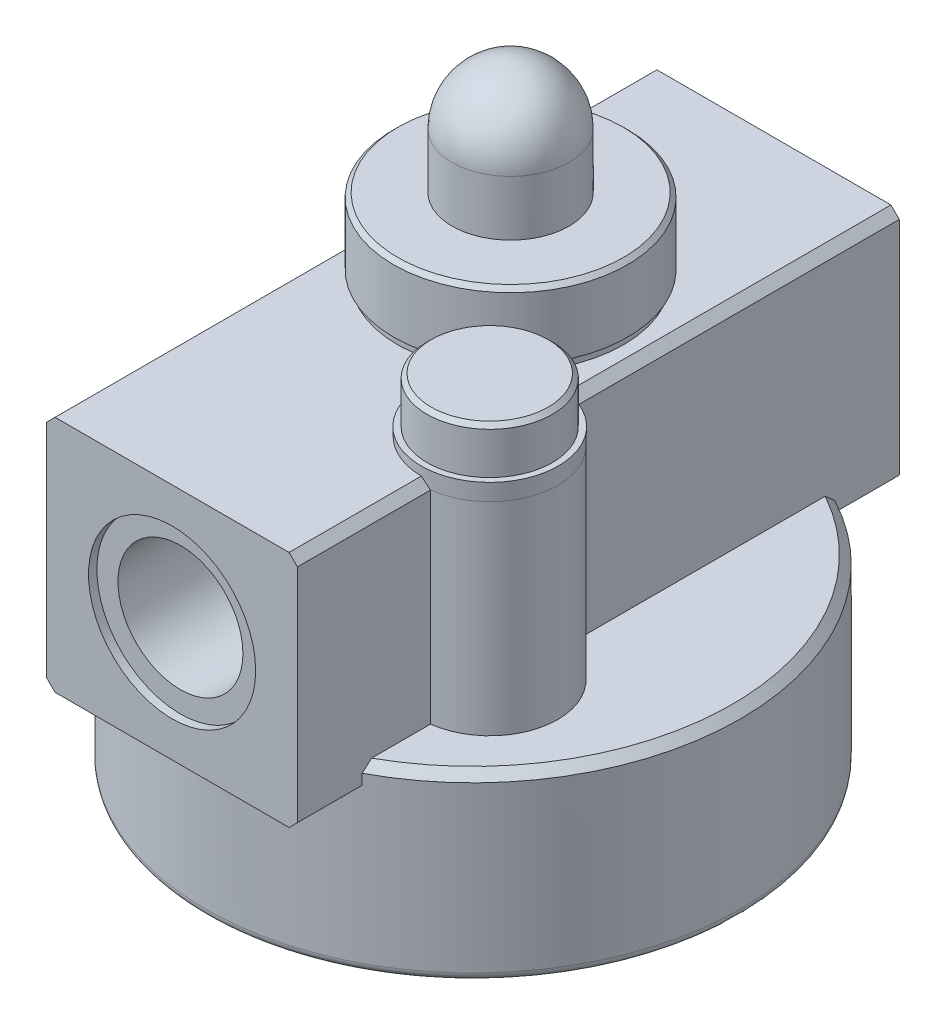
ISO-10303-21;
HEADER;
FILE_DESCRIPTION(('STEP AP214'),'2;1');
FILE_NAME('part.step','',(''),(''),'','','');
FILE_SCHEMA(('AUTOMOTIVE_DESIGN { 1 0 10303 214 1 1 1 1 }'));
ENDSEC;
DATA;
#1=APPLICATION_CONTEXT('core data for automotive mechanical design processes');
#2=APPLICATION_PROTOCOL_DEFINITION('international standard','automotive_design',2000,#1);
#3=PRODUCT_CONTEXT('',#1,'mechanical');
#4=PRODUCT('Part','Part','',(#3));
#5=PRODUCT_RELATED_PRODUCT_CATEGORY('part','',(#4));
#6=PRODUCT_DEFINITION_FORMATION('','',#4);
#7=PRODUCT_DEFINITION_CONTEXT('part definition',#1,'design');
#8=PRODUCT_DEFINITION('design','',#6,#7);
#9=PRODUCT_DEFINITION_SHAPE('','',#8);
#10=(LENGTH_UNIT() NAMED_UNIT(*) SI_UNIT(.MILLI.,.METRE.));
#11=(NAMED_UNIT(*) PLANE_ANGLE_UNIT() SI_UNIT($,.RADIAN.));
#12=(NAMED_UNIT(*) SI_UNIT($,.STERADIAN.) SOLID_ANGLE_UNIT());
#13=UNCERTAINTY_MEASURE_WITH_UNIT(LENGTH_MEASURE(1.E-05),#10,'distance_accuracy_value','');
#14=(GEOMETRIC_REPRESENTATION_CONTEXT(3) GLOBAL_UNCERTAINTY_ASSIGNED_CONTEXT((#13)) GLOBAL_UNIT_ASSIGNED_CONTEXT((#10,
#11,#12)) REPRESENTATION_CONTEXT('',''));
#15=CARTESIAN_POINT('',(0.,0.,0.));
#16=DIRECTION('',(0.,0.,1.));
#17=DIRECTION('',(1.,0.,0.));
#18=AXIS2_PLACEMENT_3D('',#15,#16,#17);
#19=CARTESIAN_POINT('',(15.,19.45,36.));
#20=DIRECTION('',(-1.,0.,0.));
#21=DIRECTION('',(0.,0.,1.));
#22=AXIS2_PLACEMENT_3D('',#19,#20,#21);
#23=PLANE('',#22);
#24=DIRECTION('',(0.,-1.,0.));
#25=VECTOR('',#24,1.);
#26=CARTESIAN_POINT('',(15.,53.5,3.92165858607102));
#27=LINE('',#26,#25);
#28=CARTESIAN_POINT('',(15.,21.7,3.92165858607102));
#29=VERTEX_POINT('',#28);
#30=CARTESIAN_POINT('',(15.,45.95,3.92165858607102));
#31=VERTEX_POINT('',#30);
#32=EDGE_CURVE('E60',#29,#31,#27,.F.);
#33=ORIENTED_EDGE('',*,*,#32,.F.);
#34=DIRECTION('',(0.,0.,-1.));
#35=VECTOR('',#34,1.);
#36=CARTESIAN_POINT('',(15.,21.7,0.));
#37=LINE('',#36,#35);
#38=CARTESIAN_POINT('',(15.,21.7,-27.1293199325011));
#39=VERTEX_POINT('',#38);
#40=EDGE_CURVE('E219',#29,#39,#37,.T.);
#41=ORIENTED_EDGE('',*,*,#40,.T.);
#42=CARTESIAN_POINT('',(15.,-17.7048872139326,68.7884303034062));
#43=CARTESIAN_POINT('',(15.,-16.7092774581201,67.769414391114));
#44=CARTESIAN_POINT('',(15.,-15.714171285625,66.7499060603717));
#45=CARTESIAN_POINT('',(15.,-13.7251356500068,64.7097405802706));
#46=CARTESIAN_POINT('',(15.,-12.7312061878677,63.6890834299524));
#47=CARTESIAN_POINT('',(15.,-10.7445802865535,61.6463398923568));
#48=CARTESIAN_POINT('',(15.,-9.75188400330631,60.6242533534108));
#49=CARTESIAN_POINT('',(15.,-7.76805569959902,58.5785636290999));
#50=CARTESIAN_POINT('',(15.,-6.77692367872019,57.5549604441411));
#51=CARTESIAN_POINT('',(15.,-4.79253510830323,55.5019026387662));
#52=CARTESIAN_POINT('',(15.,-3.79928585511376,54.472440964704));
#53=CARTESIAN_POINT('',(15.,-1.81495582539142,52.4114299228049));
#54=CARTESIAN_POINT('',(15.,-0.823875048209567,51.3798805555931));
#55=CARTESIAN_POINT('',(15.,1.15560657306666,49.3144144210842));
#56=CARTESIAN_POINT('',(15.,2.14400767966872,48.2804979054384));
#57=CARTESIAN_POINT('',(15.,4.11770827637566,46.209709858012));
#58=CARTESIAN_POINT('',(15.,5.1030077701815,45.1728383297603));
#59=CARTESIAN_POINT('',(15.,7.10515993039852,43.0582092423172));
#60=CARTESIAN_POINT('',(15.,8.12187459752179,41.9803209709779));
#61=CARTESIAN_POINT('',(15.,10.1502795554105,39.8198105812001));
#62=CARTESIAN_POINT('',(15.,11.1619698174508,38.737188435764));
#63=CARTESIAN_POINT('',(15.,12.6748824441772,37.1086274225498));
#64=CARTESIAN_POINT('',(15.,13.1784989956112,36.5649122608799));
#65=CARTESIAN_POINT('',(15.,14.1839131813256,35.4758061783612));
#66=CARTESIAN_POINT('',(15.,14.6857108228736,34.930415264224));
#67=CARTESIAN_POINT('',(15.,15.6872254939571,33.8377480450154));
#68=CARTESIAN_POINT('',(15.,16.186942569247,33.2904717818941));
#69=CARTESIAN_POINT('',(15.,17.1840104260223,32.1937523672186));
#70=CARTESIAN_POINT('',(15.,17.6813611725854,31.6443091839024));
#71=CARTESIAN_POINT('',(15.,18.6723307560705,30.5440551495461));
#72=CARTESIAN_POINT('',(15.,19.165955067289,29.9932492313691));
#73=CARTESIAN_POINT('',(15.,20.1500305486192,28.8888104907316));
#74=CARTESIAN_POINT('',(15.,20.6404817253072,28.3351776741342));
#75=CARTESIAN_POINT('',(15.,21.6176580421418,27.224650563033));
#76=CARTESIAN_POINT('',(15.,22.1043832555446,26.6677563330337));
#77=CARTESIAN_POINT('',(15.,23.0734382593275,25.5501599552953));
#78=CARTESIAN_POINT('',(15.,23.5557680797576,24.9894578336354));
#79=CARTESIAN_POINT('',(15.,24.5149416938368,23.8638687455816));
#80=CARTESIAN_POINT('',(15.,24.9917881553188,23.2989840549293));
#81=CARTESIAN_POINT('',(15.,25.9391719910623,22.1639272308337));
#82=CARTESIAN_POINT('',(15.,26.4097092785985,21.5937550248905));
#83=CARTESIAN_POINT('',(15.,27.3429952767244,20.4472145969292));
#84=CARTESIAN_POINT('',(15.,27.8057452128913,19.8708473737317));
#85=CARTESIAN_POINT('',(15.,28.7216960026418,18.710586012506));
#86=CARTESIAN_POINT('',(15.,29.1748972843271,18.1266922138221));
#87=CARTESIAN_POINT('',(15.,29.7352979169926,17.3892743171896));
#88=CARTESIAN_POINT('',(15.,29.848120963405,17.2400144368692));
#89=CARTESIAN_POINT('',(15.,30.0729461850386,16.9408769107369));
#90=CARTESIAN_POINT('',(15.,30.1849483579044,16.7909992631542));
#91=CARTESIAN_POINT('',(15.,30.5196533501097,16.3403870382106));
#92=CARTESIAN_POINT('',(15.,30.7410496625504,16.0386797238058));
#93=CARTESIAN_POINT('',(15.,31.1799111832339,15.4323680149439));
#94=CARTESIAN_POINT('',(15.,31.3973759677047,15.1277633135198));
#95=CARTESIAN_POINT('',(15.,31.8277963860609,14.5153823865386));
#96=CARTESIAN_POINT('',(15.,32.0407520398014,14.2076061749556));
#97=CARTESIAN_POINT('',(15.,32.4618909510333,13.5879656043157));
#98=CARTESIAN_POINT('',(15.,32.6700646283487,13.2760947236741));
#99=CARTESIAN_POINT('',(15.,33.0804440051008,12.648452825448));
#100=CARTESIAN_POINT('',(15.,33.2826498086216,12.33268187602));
#101=CARTESIAN_POINT('',(15.,33.6801637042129,11.6968271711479));
#102=CARTESIAN_POINT('',(15.,33.8754720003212,11.3767435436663));
#103=CARTESIAN_POINT('',(15.,34.2580677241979,10.7318308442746));
#104=CARTESIAN_POINT('',(15.,34.4453553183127,10.4070018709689));
#105=CARTESIAN_POINT('',(15.,34.9343671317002,9.53026497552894));
#106=CARTESIAN_POINT('',(15.,35.227668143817,8.97359100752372));
#107=CARTESIAN_POINT('',(15.,35.7803129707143,7.84339335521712));
#108=CARTESIAN_POINT('',(15.,36.0396517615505,7.26986719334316));
#109=CARTESIAN_POINT('',(15.,36.5131424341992,6.10693880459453));
#110=CARTESIAN_POINT('',(15.,36.7274860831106,5.51761654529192));
#111=CARTESIAN_POINT('',(15.,37.006992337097,4.6207291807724));
#112=CARTESIAN_POINT('',(15.,37.093150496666,4.31965879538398));
#113=CARTESIAN_POINT('',(15.,37.2499355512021,3.71351643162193));
#114=CARTESIAN_POINT('',(15.,37.3205642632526,3.40844492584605));
#115=CARTESIAN_POINT('',(15.,37.4722313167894,2.6593717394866));
#116=CARTESIAN_POINT('',(15.,37.5441098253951,2.21346893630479));
#117=CARTESIAN_POINT('',(15.,37.6488592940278,1.31707135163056));
#118=CARTESIAN_POINT('',(15.,37.6817372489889,0.866577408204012));
#119=CARTESIAN_POINT('',(15.,37.7004874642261,0.190450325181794));
#120=CARTESIAN_POINT('',(15.,37.701652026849,-0.0348464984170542));
#121=CARTESIAN_POINT('',(15.,37.6938396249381,-0.485270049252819));
#122=CARTESIAN_POINT('',(15.,37.6848630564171,-0.710396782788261));
#123=CARTESIAN_POINT('',(15.,37.656884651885,-1.16003921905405));
#124=CARTESIAN_POINT('',(15.,37.6378820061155,-1.38455487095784));
#125=CARTESIAN_POINT('',(15.,37.5901126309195,-1.83257236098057));
#126=CARTESIAN_POINT('',(15.,37.5613444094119,-2.05607403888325));
#127=CARTESIAN_POINT('',(15.,37.4861403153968,-2.55674882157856));
#128=CARTESIAN_POINT('',(15.,37.4370950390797,-2.83353304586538));
#129=CARTESIAN_POINT('',(15.,37.3253146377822,-3.38433964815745));
#130=CARTESIAN_POINT('',(15.,37.2625767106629,-3.65836144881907));
#131=CARTESIAN_POINT('',(15.,37.0553391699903,-4.47584126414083));
#132=CARTESIAN_POINT('',(15.,36.8918367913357,-5.0145799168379));
#133=CARTESIAN_POINT('',(15.,36.6149270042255,-5.81313925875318));
#134=CARTESIAN_POINT('',(15.,36.5169913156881,-6.07854913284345));
#135=CARTESIAN_POINT('',(15.,36.311738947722,-6.60559893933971));
#136=CARTESIAN_POINT('',(15.,36.204426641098,-6.86724056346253));
#137=CARTESIAN_POINT('',(15.,35.981419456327,-7.386882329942));
#138=CARTESIAN_POINT('',(15.,35.8657252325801,-7.64488275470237));
#139=CARTESIAN_POINT('',(15.,35.6268563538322,-8.15742794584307));
#140=CARTESIAN_POINT('',(15.,35.5036807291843,-8.41197225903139));
#141=CARTESIAN_POINT('',(15.,35.1699824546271,-9.07911357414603));
#142=CARTESIAN_POINT('',(15.,34.9538768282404,-9.48892187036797));
#143=CARTESIAN_POINT('',(15.,34.5069941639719,-10.300494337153));
#144=CARTESIAN_POINT('',(15.,34.2762145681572,-10.7022570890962));
#145=CARTESIAN_POINT('',(15.,33.8023877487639,-11.4987952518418));
#146=CARTESIAN_POINT('',(15.,33.5593330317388,-11.8935661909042));
#147=CARTESIAN_POINT('',(15.,33.0631418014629,-12.6766690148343));
#148=CARTESIAN_POINT('',(15.,32.8100058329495,-13.0650012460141));
#149=CARTESIAN_POINT('',(15.,32.2946096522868,-13.8370063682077));
#150=CARTESIAN_POINT('',(15.,32.0323274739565,-14.220664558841));
#151=CARTESIAN_POINT('',(15.,31.500591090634,-14.9829740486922));
#152=CARTESIAN_POINT('',(15.,31.2311368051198,-15.3616252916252));
#153=CARTESIAN_POINT('',(15.,30.6862304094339,-16.1143870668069));
#154=CARTESIAN_POINT('',(15.,30.4107803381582,-16.4884990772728));
#155=CARTESIAN_POINT('',(15.,29.8546645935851,-17.2328303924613));
#156=CARTESIAN_POINT('',(15.,29.5739988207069,-17.6030496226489));
#157=CARTESIAN_POINT('',(15.,28.7200910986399,-18.7153380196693));
#158=CARTESIAN_POINT('',(15.,28.1399763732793,-19.4521339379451));
#159=CARTESIAN_POINT('',(15.,26.9660400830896,-20.9147433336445));
#160=CARTESIAN_POINT('',(15.,26.3722176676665,-21.6405561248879));
#161=CARTESIAN_POINT('',(15.,25.1749844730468,-23.0821879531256));
#162=CARTESIAN_POINT('',(15.,24.571591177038,-23.7980215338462));
#163=CARTESIAN_POINT('',(15.,23.3565145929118,-25.2225723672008));
#164=CARTESIAN_POINT('',(15.,22.7448315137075,-25.9312897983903));
#165=CARTESIAN_POINT('',(15.,21.3168459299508,-27.5701346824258));
#166=CARTESIAN_POINT('',(15.,20.4980595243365,-28.4980960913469));
#167=CARTESIAN_POINT('',(15.,18.8516290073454,-30.3461359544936));
#168=CARTESIAN_POINT('',(15.,18.023984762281,-31.266214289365));
#169=CARTESIAN_POINT('',(15.,16.3617295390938,-33.1001493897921));
#170=CARTESIAN_POINT('',(15.,15.527118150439,-34.0140057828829));
#171=CARTESIAN_POINT('',(15.,13.8523958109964,-35.8366513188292));
#172=CARTESIAN_POINT('',(15.,13.0122848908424,-36.7454404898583));
#173=CARTESIAN_POINT('',(15.,11.3268590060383,-38.5596881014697));
#174=CARTESIAN_POINT('',(15.,10.4815400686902,-39.4651428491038));
#175=CARTESIAN_POINT('',(15.,8.78724232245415,-41.2726218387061));
#176=CARTESIAN_POINT('',(15.,7.93826350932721,-42.1746460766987));
#177=CARTESIAN_POINT('',(15.,6.23729649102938,-43.9757947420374));
#178=CARTESIAN_POINT('',(15.,5.38530838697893,-44.8749192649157));
#179=CARTESIAN_POINT('',(15.,3.67877860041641,-46.6707422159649));
#180=CARTESIAN_POINT('',(15.,2.82423691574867,-47.5674406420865));
#181=CARTESIAN_POINT('',(15.,0.33933318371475,-50.1686622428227));
#182=CARTESIAN_POINT('',(15.,-1.29385656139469,-51.8704842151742));
#183=CARTESIAN_POINT('',(15.,-4.56606700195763,-55.2685403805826));
#184=CARTESIAN_POINT('',(15.,-6.20508775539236,-56.9647745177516));
#185=CARTESIAN_POINT('',(15.,-9.48560594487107,-60.3508514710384));
#186=CARTESIAN_POINT('',(15.,-11.1270979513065,-62.0406995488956));
#187=CARTESIAN_POINT('',(15.,-13.5919493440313,-64.5729026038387));
#188=CARTESIAN_POINT('',(15.,-14.4139961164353,-65.4165360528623));
#189=CARTESIAN_POINT('',(15.,-16.0588749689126,-67.1030364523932));
#190=CARTESIAN_POINT('',(15.,-16.8817070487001,-67.9459034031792));
#191=CARTESIAN_POINT('',(15.,-17.7048872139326,-68.7884303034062));
#192=B_SPLINE_CURVE_WITH_KNOTS('',3,(#42,#43,#44,#45,#46,#47,#48,#49,#50,#51,#52,#53,#54,#55,
#56,#57,#58,#59,#60,#61,#62,#63,#64,#65,#66,#67,#68,#69,#70,#71,#72,#73,#74,#75,#76,#77,#78,#79,
#80,#81,#82,#83,#84,#85,#86,#87,#88,#89,#90,#91,#92,#93,#94,#95,#96,#97,#98,#99,#100,#101,#102,
#103,#104,#105,#106,#107,#108,#109,#110,#111,#112,#113,#114,#115,#116,#117,#118,#119,#120,#121,
#122,#123,#124,#125,#126,#127,#128,#129,#130,#131,#132,#133,#134,#135,#136,#137,#138,#139,#140,
#141,#142,#143,#144,#145,#146,#147,#148,#149,#150,#151,#152,#153,#154,#155,#156,#157,#158,#159,
#160,#161,#162,#163,#164,#165,#166,#167,#168,#169,#170,#171,#172,#173,#174,#175,#176,#177,#178,
#179,#180,#181,#182,#183,#184,#185,#186,#187,#188,#189,#190,#191),.UNSPECIFIED.,.F.,.F.,(4,2,2,
2,2,2,2,2,2,2,2,2,2,2,2,2,2,2,2,2,2,2,2,2,2,2,2,2,2,2,2,2,2,2,2,2,2,2,2,2,2,2,2,2,2,2,2,2,2,2,2,
2,2,2,2,2,2,2,2,2,2,2,2,2,2,2,2,2,2,2,2,2,2,2,4),(0.,4.27395508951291,8.54791375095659,
12.8223667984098,17.0968187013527,21.3883214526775,25.6798229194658,29.9708875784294,
34.2619471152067,38.7071535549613,43.152385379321,45.3757359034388,47.5990775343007,
49.8223700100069,52.0456951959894,54.2645738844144,56.4834479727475,58.7022783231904,
60.9210934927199,63.1387791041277,65.3564951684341,67.5738588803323,69.7911229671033,
70.3524300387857,70.9137387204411,72.0363807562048,73.1591430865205,74.2819004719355,
75.4067394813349,76.5315588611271,77.6563449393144,78.7811076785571,80.6677990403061,
82.5547691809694,84.4335261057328,85.372643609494,86.311651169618,87.6650240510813,
89.018154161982,89.6938613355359,90.3695421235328,91.0452774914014,91.7211161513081,
92.5640072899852,93.4070710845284,95.0936032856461,95.9421936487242,96.7903903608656,
97.6385209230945,98.4867616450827,99.8762592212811,101.26599967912,102.656599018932,
104.047123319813,105.441254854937,106.835402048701,108.229082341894,109.622789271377,
112.435834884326,115.249055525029,118.057623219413,120.866120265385,124.578683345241,
128.291302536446,132.004142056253,135.716960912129,139.433090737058,143.149224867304,
146.865235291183,150.581248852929,157.657353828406,164.733529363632,171.801106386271,
175.334844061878,178.868580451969),.UNSPECIFIED.);
#193=CARTESIAN_POINT('',(15.,20.7,-28.2665880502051));
#194=VERTEX_POINT('',#193);
#195=EDGE_CURVE('E297',#39,#194,#192,.T.);
#196=ORIENTED_EDGE('',*,*,#195,.T.);
#197=DIRECTION('',(0.,-1.,0.));
#198=VECTOR('',#197,1.);
#199=CARTESIAN_POINT('',(15.,21.7,-28.2665880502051));
#200=LINE('',#199,#198);
#201=CARTESIAN_POINT('',(15.,19.45,-28.2665880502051));
#202=VERTEX_POINT('',#201);
#203=EDGE_CURVE('E255',#194,#202,#200,.T.);
#204=ORIENTED_EDGE('',*,*,#203,.T.);
#205=DIRECTION('',(0.,0.,-1.));
#206=VECTOR('',#205,1.);
#207=CARTESIAN_POINT('',(15.,19.45,36.));
#208=LINE('',#207,#206);
#209=CARTESIAN_POINT('',(15.,19.45,-36.));
#210=VERTEX_POINT('',#209);
#211=EDGE_CURVE('E320',#202,#210,#208,.T.);
#212=ORIENTED_EDGE('',*,*,#211,.T.);
#213=DIRECTION('',(0.,1.,0.));
#214=VECTOR('',#213,1.);
#215=CARTESIAN_POINT('',(15.,19.45,-36.));
#216=LINE('',#215,#214);
#217=CARTESIAN_POINT('',(15.,45.95,-36.));
#218=VERTEX_POINT('',#217);
#219=EDGE_CURVE('E372',#210,#218,#216,.T.);
#220=ORIENTED_EDGE('',*,*,#219,.T.);
#221=DIRECTION('',(0.,0.,-1.));
#222=VECTOR('',#221,1.);
#223=CARTESIAN_POINT('',(15.,45.95,36.));
#224=LINE('',#223,#222);
#225=EDGE_CURVE('E332',#31,#218,#224,.T.);
#226=ORIENTED_EDGE('',*,*,#225,.F.);
#227=EDGE_LOOP('',(#33,#41,#196,#204,#212,#220,#226));
#228=FACE_BOUND('',#227,.T.);
#229=ADVANCED_FACE('F37',(#228),#23,.F.);
#230=DIRECTION('',(0.,-1.,0.));
#231=VECTOR('',#230,1.);
#232=CARTESIAN_POINT('',(15.,53.5,20.078341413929));
#233=LINE('',#232,#231);
#234=CARTESIAN_POINT('',(15.,45.95,20.078341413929));
#235=VERTEX_POINT('',#234);
#236=CARTESIAN_POINT('',(15.,21.7,20.078341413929));
#237=VERTEX_POINT('',#236);
#238=EDGE_CURVE('E410',#235,#237,#233,.T.);
#239=ORIENTED_EDGE('',*,*,#238,.F.);
#240=CARTESIAN_POINT('',(15.,45.95,36.));
#241=VERTEX_POINT('',#240);
#242=EDGE_CURVE('E328',#241,#235,#224,.T.);
#243=ORIENTED_EDGE('',*,*,#242,.F.);
#244=DIRECTION('',(0.,1.,0.));
#245=VECTOR('',#244,1.);
#246=CARTESIAN_POINT('',(15.,19.45,36.));
#247=LINE('',#246,#245);
#248=CARTESIAN_POINT('',(15.,19.45,36.));
#249=VERTEX_POINT('',#248);
#250=EDGE_CURVE('E389',#249,#241,#247,.T.);
#251=ORIENTED_EDGE('',*,*,#250,.F.);
#252=CARTESIAN_POINT('',(15.,19.45,28.2665880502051));
#253=VERTEX_POINT('',#252);
#254=EDGE_CURVE('E327',#249,#253,#208,.T.);
#255=ORIENTED_EDGE('',*,*,#254,.T.);
#256=DIRECTION('',(0.,-1.,0.));
#257=VECTOR('',#256,1.);
#258=CARTESIAN_POINT('',(15.,21.7,28.2665880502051));
#259=LINE('',#258,#257);
#260=CARTESIAN_POINT('',(15.,20.7,28.2665880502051));
#261=VERTEX_POINT('',#260);
#262=EDGE_CURVE('E306',#253,#261,#259,.F.);
#263=ORIENTED_EDGE('',*,*,#262,.T.);
#264=CARTESIAN_POINT('',(15.,21.7,27.1293199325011));
#265=VERTEX_POINT('',#264);
#266=EDGE_CURVE('E303',#261,#265,#192,.T.);
#267=ORIENTED_EDGE('',*,*,#266,.T.);
#268=EDGE_CURVE('E216',#265,#237,#37,.T.);
#269=ORIENTED_EDGE('',*,*,#268,.T.);
#270=EDGE_LOOP('',(#239,#243,#251,#255,#263,#267,#269));
#271=FACE_BOUND('',#270,.T.);
#272=ADVANCED_FACE('F283',(#271),#23,.F.);
#273=CARTESIAN_POINT('',(15.,45.95,36.));
#274=DIRECTION('',(-0.707106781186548,-0.707106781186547,0.));
#275=DIRECTION('',(0.707106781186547,-0.707106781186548,0.));
#276=AXIS2_PLACEMENT_3D('',#273,#274,#275);
#277=PLANE('',#276);
#278=CARTESIAN_POINT('',(13.7606944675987,47.1893055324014,12.));
#279=DIRECTION('',(-0.707106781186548,-0.707106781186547,0.));
#280=DIRECTION('',(-0.707106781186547,0.707106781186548,0.));
#281=AXIS2_PLACEMENT_3D('',#278,#279,#280);
#282=ELLIPSE('',#281,11.5629952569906,8.17276957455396);
#283=CARTESIAN_POINT('',(14.,46.95,20.1692682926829));
#284=VERTEX_POINT('',#283);
#285=EDGE_CURVE('E407',#284,#235,#282,.F.);
#286=ORIENTED_EDGE('',*,*,#285,.F.);
#287=DIRECTION('',(0.,0.,-1.));
#288=VECTOR('',#287,1.);
#289=CARTESIAN_POINT('',(14.,46.95,36.));
#290=LINE('',#289,#288);
#291=CARTESIAN_POINT('',(14.,46.95,36.));
#292=VERTEX_POINT('',#291);
#293=EDGE_CURVE('E394',#292,#284,#290,.T.);
#294=ORIENTED_EDGE('',*,*,#293,.F.);
#295=DIRECTION('',(-0.707106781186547,0.707106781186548,0.));
#296=VECTOR('',#295,1.);
#297=CARTESIAN_POINT('',(15.,45.95,36.));
#298=LINE('',#297,#296);
#299=EDGE_CURVE('E391',#241,#292,#298,.T.);
#300=ORIENTED_EDGE('',*,*,#299,.F.);
#301=ORIENTED_EDGE('',*,*,#242,.T.);
#302=EDGE_LOOP('',(#286,#294,#300,#301));
#303=FACE_BOUND('',#302,.T.);
#304=ADVANCED_FACE('F288',(#303),#277,.F.);
#305=CARTESIAN_POINT('',(0.,21.7,0.));
#306=DIRECTION('',(0.,-1.,0.));
#307=DIRECTION('',(0.,0.,-1.));
#308=AXIS2_PLACEMENT_3D('',#305,#306,#307);
#309=CYLINDRICAL_SURFACE('',#308,32.);
#310=CARTESIAN_POINT('',(0.,1.00000000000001,0.));
#311=DIRECTION('',(0.,-1.,0.));
#312=DIRECTION('',(0.,0.,-1.));
#313=AXIS2_PLACEMENT_3D('',#310,#311,#312);
#314=CIRCLE('',#313,32.);
#315=CARTESIAN_POINT('',(0.,1.00000000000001,-32.));
#316=VERTEX_POINT('',#315);
#317=EDGE_CURVE('E229',#316,#316,#314,.T.);
#318=ORIENTED_EDGE('',*,*,#317,.F.);
#319=EDGE_LOOP('',(#318));
#320=FACE_BOUND('',#319,.T.);
#321=DIRECTION('',(0.,-1.,0.));
#322=VECTOR('',#321,1.);
#323=CARTESIAN_POINT('',(-15.,21.7,-28.2665880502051));
#324=LINE('',#323,#322);
#325=CARTESIAN_POINT('',(-15.,19.45,-28.2665880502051));
#326=VERTEX_POINT('',#325);
#327=CARTESIAN_POINT('',(-15.,20.7,-28.2665880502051));
#328=VERTEX_POINT('',#327);
#329=EDGE_CURVE('E243',#326,#328,#324,.F.);
#330=ORIENTED_EDGE('',*,*,#329,.F.);
#331=CARTESIAN_POINT('',(0.,4.45000000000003,0.));
#332=DIRECTION('',(0.707106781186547,0.707106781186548,0.));
#333=DIRECTION('',(0.707106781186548,-0.707106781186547,0.));
#334=AXIS2_PLACEMENT_3D('',#331,#332,#333);
#335=ELLIPSE('',#334,45.254833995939,32.);
#336=CARTESIAN_POINT('',(-14.,18.45,-28.7749891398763));
#337=VERTEX_POINT('',#336);
#338=EDGE_CURVE('E196',#337,#326,#335,.T.);
#339=ORIENTED_EDGE('',*,*,#338,.F.);
#340=CARTESIAN_POINT('',(0.,18.45,0.));
#341=DIRECTION('',(0.,1.,0.));
#342=DIRECTION('',(0.,0.,1.));
#343=AXIS2_PLACEMENT_3D('',#340,#341,#342);
#344=CIRCLE('',#343,32.);
#345=CARTESIAN_POINT('',(14.,18.45,-28.7749891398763));
#346=VERTEX_POINT('',#345);
#347=EDGE_CURVE('E201',#346,#337,#344,.T.);
#348=ORIENTED_EDGE('',*,*,#347,.F.);
#349=CARTESIAN_POINT('',(0.,4.45000000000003,0.));
#350=DIRECTION('',(-0.707106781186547,0.707106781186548,0.));
#351=DIRECTION('',(-0.707106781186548,-0.707106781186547,0.));
#352=AXIS2_PLACEMENT_3D('',#349,#350,#351);
#353=ELLIPSE('',#352,45.254833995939,32.);
#354=EDGE_CURVE('E206',#202,#346,#353,.T.);
#355=ORIENTED_EDGE('',*,*,#354,.F.);
#356=ORIENTED_EDGE('',*,*,#203,.F.);
#357=CARTESIAN_POINT('',(0.,20.7,0.));
#358=DIRECTION('',(0.,-1.,0.));
#359=DIRECTION('',(0.,0.,-1.));
#360=AXIS2_PLACEMENT_3D('',#357,#358,#359);
#361=CIRCLE('',#360,32.);
#362=EDGE_CURVE('E232',#194,#261,#361,.T.);
#363=ORIENTED_EDGE('',*,*,#362,.T.);
#364=ORIENTED_EDGE('',*,*,#262,.F.);
#365=CARTESIAN_POINT('',(14.,18.45,28.7749891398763));
#366=VERTEX_POINT('',#365);
#367=EDGE_CURVE('E210',#366,#253,#353,.T.);
#368=ORIENTED_EDGE('',*,*,#367,.F.);
#369=CARTESIAN_POINT('',(-14.,18.45,28.7749891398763));
#370=VERTEX_POINT('',#369);
#371=EDGE_CURVE('E207',#370,#366,#344,.T.);
#372=ORIENTED_EDGE('',*,*,#371,.F.);
#373=CARTESIAN_POINT('',(-15.,19.45,28.2665880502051));
#374=VERTEX_POINT('',#373);
#375=EDGE_CURVE('E203',#374,#370,#335,.T.);
#376=ORIENTED_EDGE('',*,*,#375,.F.);
#377=DIRECTION('',(0.,-1.,0.));
#378=VECTOR('',#377,1.);
#379=CARTESIAN_POINT('',(-15.,21.7,28.2665880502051));
#380=LINE('',#379,#378);
#381=CARTESIAN_POINT('',(-15.,20.7,28.2665880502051));
#382=VERTEX_POINT('',#381);
#383=EDGE_CURVE('E240',#382,#374,#380,.T.);
#384=ORIENTED_EDGE('',*,*,#383,.F.);
#385=EDGE_CURVE('E235',#382,#328,#361,.T.);
#386=ORIENTED_EDGE('',*,*,#385,.T.);
#387=EDGE_LOOP('',(#330,#339,#348,#355,#356,#363,#364,#368,#372,#376,#384,#386));
#388=FACE_BOUND('',#387,.T.);
#389=ADVANCED_FACE('F316',(#320,#388),#309,.T.);
#390=CARTESIAN_POINT('',(0.,21.7,0.));
#391=DIRECTION('',(0.,-1.,0.));
#392=DIRECTION('',(0.,0.,-1.));
#393=AXIS2_PLACEMENT_3D('',#390,#391,#392);
#394=CONICAL_SURFACE('',#393,31.,0.785398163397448);
#395=CARTESIAN_POINT('',(-15.,-17.7048872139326,-68.7884303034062));
#396=CARTESIAN_POINT('',(-15.,-16.7092774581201,-67.769414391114));
#397=CARTESIAN_POINT('',(-15.,-15.714171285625,-66.7499060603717));
#398=CARTESIAN_POINT('',(-15.,-13.7251356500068,-64.7097405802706));
#399=CARTESIAN_POINT('',(-15.,-12.7312061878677,-63.6890834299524));
#400=CARTESIAN_POINT('',(-15.,-10.7445802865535,-61.6463398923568));
#401=CARTESIAN_POINT('',(-15.,-9.7518840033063,-60.6242533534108));
#402=CARTESIAN_POINT('',(-15.,-7.76805569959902,-58.5785636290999));
#403=CARTESIAN_POINT('',(-15.,-6.77692367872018,-57.5549604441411));
#404=CARTESIAN_POINT('',(-15.,-4.79253510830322,-55.5019026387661));
#405=CARTESIAN_POINT('',(-15.,-3.79928585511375,-54.4724409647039));
#406=CARTESIAN_POINT('',(-15.,-1.81495582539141,-52.4114299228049));
#407=CARTESIAN_POINT('',(-15.,-0.823875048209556,-51.3798805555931));
#408=CARTESIAN_POINT('',(-15.,1.15560657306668,-49.3144144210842));
#409=CARTESIAN_POINT('',(-15.,2.14400767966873,-48.2804979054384));
#410=CARTESIAN_POINT('',(-15.,4.11770827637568,-46.209709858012));
#411=CARTESIAN_POINT('',(-15.,5.10300777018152,-45.1728383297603));
#412=CARTESIAN_POINT('',(-15.,7.10515993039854,-43.0582092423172));
#413=CARTESIAN_POINT('',(-15.,8.1218745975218,-41.9803209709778));
#414=CARTESIAN_POINT('',(-15.,10.1502795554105,-39.8198105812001));
#415=CARTESIAN_POINT('',(-15.,11.1619698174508,-38.737188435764));
#416=CARTESIAN_POINT('',(-15.,12.6748824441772,-37.1086274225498));
#417=CARTESIAN_POINT('',(-15.,13.1784989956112,-36.5649122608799));
#418=CARTESIAN_POINT('',(-15.,14.1839131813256,-35.4758061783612));
#419=CARTESIAN_POINT('',(-15.,14.6857108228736,-34.930415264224));
#420=CARTESIAN_POINT('',(-15.,15.6872254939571,-33.8377480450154));
#421=CARTESIAN_POINT('',(-15.,16.186942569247,-33.2904717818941));
#422=CARTESIAN_POINT('',(-15.,17.1840104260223,-32.1937523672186));
#423=CARTESIAN_POINT('',(-15.,17.6813611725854,-31.6443091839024));
#424=CARTESIAN_POINT('',(-15.,18.6723307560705,-30.5440551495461));
#425=CARTESIAN_POINT('',(-15.,19.165955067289,-29.9932492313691));
#426=CARTESIAN_POINT('',(-15.,20.1500305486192,-28.8888104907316));
#427=CARTESIAN_POINT('',(-15.,20.6404817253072,-28.3351776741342));
#428=CARTESIAN_POINT('',(-15.,21.6176580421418,-27.224650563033));
#429=CARTESIAN_POINT('',(-15.,22.1043832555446,-26.6677563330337));
#430=CARTESIAN_POINT('',(-15.,23.0734382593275,-25.5501599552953));
#431=CARTESIAN_POINT('',(-15.,23.5557680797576,-24.9894578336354));
#432=CARTESIAN_POINT('',(-15.,24.5149416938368,-23.8638687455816));
#433=CARTESIAN_POINT('',(-15.,24.9917881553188,-23.2989840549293));
#434=CARTESIAN_POINT('',(-15.,25.9391719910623,-22.1639272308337));
#435=CARTESIAN_POINT('',(-15.,26.4097092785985,-21.5937550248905));
#436=CARTESIAN_POINT('',(-15.,27.3429952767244,-20.4472145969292));
#437=CARTESIAN_POINT('',(-15.,27.8057452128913,-19.8708473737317));
#438=CARTESIAN_POINT('',(-15.,28.7216960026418,-18.710586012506));
#439=CARTESIAN_POINT('',(-15.,29.1748972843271,-18.1266922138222));
#440=CARTESIAN_POINT('',(-15.,29.7352979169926,-17.3892743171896));
#441=CARTESIAN_POINT('',(-15.,29.848120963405,-17.2400144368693));
#442=CARTESIAN_POINT('',(-15.,30.0729461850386,-16.9408769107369));
#443=CARTESIAN_POINT('',(-15.,30.1849483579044,-16.7909992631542));
#444=CARTESIAN_POINT('',(-15.,30.5196533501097,-16.3403870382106));
#445=CARTESIAN_POINT('',(-15.,30.7410496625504,-16.0386797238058));
#446=CARTESIAN_POINT('',(-15.,31.1799111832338,-15.4323680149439));
#447=CARTESIAN_POINT('',(-15.,31.3973759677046,-15.1277633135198));
#448=CARTESIAN_POINT('',(-15.,31.8277963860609,-14.5153823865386));
#449=CARTESIAN_POINT('',(-15.,32.0407520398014,-14.2076061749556));
#450=CARTESIAN_POINT('',(-15.,32.4618909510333,-13.5879656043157));
#451=CARTESIAN_POINT('',(-15.,32.6700646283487,-13.2760947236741));
#452=CARTESIAN_POINT('',(-15.,33.0804440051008,-12.648452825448));
#453=CARTESIAN_POINT('',(-15.,33.2826498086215,-12.33268187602));
#454=CARTESIAN_POINT('',(-15.,33.6801637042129,-11.6968271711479));
#455=CARTESIAN_POINT('',(-15.,33.8754720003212,-11.3767435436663));
#456=CARTESIAN_POINT('',(-15.,34.2580677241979,-10.7318308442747));
#457=CARTESIAN_POINT('',(-15.,34.4453553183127,-10.4070018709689));
#458=CARTESIAN_POINT('',(-15.,34.9343671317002,-9.53026497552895));
#459=CARTESIAN_POINT('',(-15.,35.227668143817,-8.97359100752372));
#460=CARTESIAN_POINT('',(-15.,35.7803129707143,-7.84339335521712));
#461=CARTESIAN_POINT('',(-15.,36.0396517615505,-7.26986719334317));
#462=CARTESIAN_POINT('',(-15.,36.5131424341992,-6.10693880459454));
#463=CARTESIAN_POINT('',(-15.,36.7274860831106,-5.51761654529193));
#464=CARTESIAN_POINT('',(-15.,37.006992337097,-4.6207291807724));
#465=CARTESIAN_POINT('',(-15.,37.093150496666,-4.31965879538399));
#466=CARTESIAN_POINT('',(-15.,37.2499355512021,-3.71351643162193));
#467=CARTESIAN_POINT('',(-15.,37.3205642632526,-3.40844492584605));
#468=CARTESIAN_POINT('',(-15.,37.4722313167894,-2.6593717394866));
#469=CARTESIAN_POINT('',(-15.,37.5441098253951,-2.21346893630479));
#470=CARTESIAN_POINT('',(-15.,37.6488592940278,-1.31707135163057));
#471=CARTESIAN_POINT('',(-15.,37.6817372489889,-0.866577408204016));
#472=CARTESIAN_POINT('',(-15.,37.7004874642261,-0.190450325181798));
#473=CARTESIAN_POINT('',(-15.,37.701652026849,0.03484649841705));
#474=CARTESIAN_POINT('',(-15.,37.6938396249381,0.485270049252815));
#475=CARTESIAN_POINT('',(-15.,37.6848630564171,0.710396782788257));
#476=CARTESIAN_POINT('',(-15.,37.656884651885,1.16003921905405));
#477=CARTESIAN_POINT('',(-15.,37.6378820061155,1.38455487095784));
#478=CARTESIAN_POINT('',(-15.,37.5901126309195,1.83257236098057));
#479=CARTESIAN_POINT('',(-15.,37.5613444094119,2.05607403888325));
#480=CARTESIAN_POINT('',(-15.,37.4861403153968,2.55674882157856));
#481=CARTESIAN_POINT('',(-15.,37.4370950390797,2.83353304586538));
#482=CARTESIAN_POINT('',(-15.,37.3253146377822,3.38433964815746));
#483=CARTESIAN_POINT('',(-15.,37.2625767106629,3.65836144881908));
#484=CARTESIAN_POINT('',(-15.,37.0553391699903,4.47584126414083));
#485=CARTESIAN_POINT('',(-15.,36.8918367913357,5.01457991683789));
#486=CARTESIAN_POINT('',(-15.,36.6149270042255,5.81313925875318));
#487=CARTESIAN_POINT('',(-15.,36.5169913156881,6.07854913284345));
#488=CARTESIAN_POINT('',(-15.,36.311738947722,6.60559893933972));
#489=CARTESIAN_POINT('',(-15.,36.204426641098,6.86724056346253));
#490=CARTESIAN_POINT('',(-15.,35.981419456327,7.38688232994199));
#491=CARTESIAN_POINT('',(-15.,35.8657252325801,7.64488275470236));
#492=CARTESIAN_POINT('',(-15.,35.6268563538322,8.15742794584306));
#493=CARTESIAN_POINT('',(-15.,35.5036807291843,8.41197225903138));
#494=CARTESIAN_POINT('',(-15.,35.1699824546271,9.07911357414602));
#495=CARTESIAN_POINT('',(-15.,34.9538768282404,9.48892187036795));
#496=CARTESIAN_POINT('',(-15.,34.5069941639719,10.300494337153));
#497=CARTESIAN_POINT('',(-15.,34.2762145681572,10.7022570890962));
#498=CARTESIAN_POINT('',(-15.,33.8023877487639,11.4987952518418));
#499=CARTESIAN_POINT('',(-15.,33.5593330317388,11.8935661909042));
#500=CARTESIAN_POINT('',(-15.,33.0631418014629,12.6766690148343));
#501=CARTESIAN_POINT('',(-15.,32.8100058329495,13.0650012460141));
#502=CARTESIAN_POINT('',(-15.,32.2946096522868,13.8370063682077));
#503=CARTESIAN_POINT('',(-15.,32.0323274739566,14.220664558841));
#504=CARTESIAN_POINT('',(-15.,31.500591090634,14.9829740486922));
#505=CARTESIAN_POINT('',(-15.,31.2311368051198,15.3616252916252));
#506=CARTESIAN_POINT('',(-15.,30.6862304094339,16.1143870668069));
#507=CARTESIAN_POINT('',(-15.,30.4107803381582,16.4884990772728));
#508=CARTESIAN_POINT('',(-15.,29.8546645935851,17.2328303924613));
#509=CARTESIAN_POINT('',(-15.,29.5739988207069,17.6030496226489));
#510=CARTESIAN_POINT('',(-15.,28.7200910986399,18.7153380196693));
#511=CARTESIAN_POINT('',(-15.,28.1399763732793,19.4521339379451));
#512=CARTESIAN_POINT('',(-15.,26.9660400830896,20.9147433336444));
#513=CARTESIAN_POINT('',(-15.,26.3722176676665,21.6405561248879));
#514=CARTESIAN_POINT('',(-15.,25.1749844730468,23.0821879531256));
#515=CARTESIAN_POINT('',(-15.,24.5715911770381,23.7980215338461));
#516=CARTESIAN_POINT('',(-15.,23.3565145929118,25.2225723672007));
#517=CARTESIAN_POINT('',(-15.,22.7448315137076,25.9312897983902));
#518=CARTESIAN_POINT('',(-15.,21.3168459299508,27.5701346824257));
#519=CARTESIAN_POINT('',(-15.,20.4980595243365,28.4980960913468));
#520=CARTESIAN_POINT('',(-15.,18.8516290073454,30.3461359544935));
#521=CARTESIAN_POINT('',(-15.,18.0239847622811,31.2662142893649));
#522=CARTESIAN_POINT('',(-15.,16.3617295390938,33.100149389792));
#523=CARTESIAN_POINT('',(-15.,15.5271181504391,34.0140057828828));
#524=CARTESIAN_POINT('',(-15.,13.8523958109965,35.8366513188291));
#525=CARTESIAN_POINT('',(-15.,13.0122848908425,36.7454404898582));
#526=CARTESIAN_POINT('',(-15.,11.3268590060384,38.5596881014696));
#527=CARTESIAN_POINT('',(-15.,10.4815400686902,39.4651428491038));
#528=CARTESIAN_POINT('',(-15.,8.78724232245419,41.2726218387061));
#529=CARTESIAN_POINT('',(-15.,7.93826350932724,42.1746460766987));
#530=CARTESIAN_POINT('',(-15.,6.2372964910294,43.9757947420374));
#531=CARTESIAN_POINT('',(-15.,5.38530838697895,44.8749192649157));
#532=CARTESIAN_POINT('',(-15.,3.67877860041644,46.6707422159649));
#533=CARTESIAN_POINT('',(-15.,2.82423691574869,47.5674406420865));
#534=CARTESIAN_POINT('',(-15.,0.339333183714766,50.1686622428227));
#535=CARTESIAN_POINT('',(-15.,-1.29385656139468,51.8704842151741));
#536=CARTESIAN_POINT('',(-15.,-4.56606700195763,55.2685403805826));
#537=CARTESIAN_POINT('',(-15.,-6.20508775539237,56.9647745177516));
#538=CARTESIAN_POINT('',(-15.,-9.4856059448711,60.3508514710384));
#539=CARTESIAN_POINT('',(-15.,-11.1270979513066,62.0406995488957));
#540=CARTESIAN_POINT('',(-15.,-13.5919493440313,64.5729026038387));
#541=CARTESIAN_POINT('',(-15.,-14.4139961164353,65.4165360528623));
#542=CARTESIAN_POINT('',(-15.,-16.0588749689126,67.1030364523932));
#543=CARTESIAN_POINT('',(-15.,-16.8817070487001,67.9459034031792));
#544=CARTESIAN_POINT('',(-15.,-17.7048872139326,68.7884303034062));
#545=B_SPLINE_CURVE_WITH_KNOTS('',3,(#395,#396,#397,#398,#399,#400,#401,#402,#403,#404,#405,
#406,#407,#408,#409,#410,#411,#412,#413,#414,#415,#416,#417,#418,#419,#420,#421,#422,#423,#424,
#425,#426,#427,#428,#429,#430,#431,#432,#433,#434,#435,#436,#437,#438,#439,#440,#441,#442,#443,
#444,#445,#446,#447,#448,#449,#450,#451,#452,#453,#454,#455,#456,#457,#458,#459,#460,#461,#462,
#463,#464,#465,#466,#467,#468,#469,#470,#471,#472,#473,#474,#475,#476,#477,#478,#479,#480,#481,
#482,#483,#484,#485,#486,#487,#488,#489,#490,#491,#492,#493,#494,#495,#496,#497,#498,#499,#500,
#501,#502,#503,#504,#505,#506,#507,#508,#509,#510,#511,#512,#513,#514,#515,#516,#517,#518,#519,
#520,#521,#522,#523,#524,#525,#526,#527,#528,#529,#530,#531,#532,#533,#534,#535,#536,#537,#538,
#539,#540,#541,#542,#543,#544),.UNSPECIFIED.,.F.,.F.,(4,2,2,2,2,2,2,2,2,2,2,2,2,2,2,2,2,2,2,2,2,
2,2,2,2,2,2,2,2,2,2,2,2,2,2,2,2,2,2,2,2,2,2,2,2,2,2,2,2,2,2,2,2,2,2,2,2,2,2,2,2,2,2,2,2,2,2,2,2,
2,2,2,2,2,4),(0.,4.27395508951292,8.5479137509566,12.8223667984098,17.0968187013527,
21.3883214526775,25.6798229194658,29.9708875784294,34.2619471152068,38.7071535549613,
43.1523853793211,45.3757359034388,47.5990775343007,49.8223700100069,52.0456951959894,
54.2645738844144,56.4834479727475,58.7022783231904,60.9210934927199,63.1387791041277,
65.3564951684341,67.5738588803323,69.7911229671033,70.3524300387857,70.9137387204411,
72.0363807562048,73.1591430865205,74.2819004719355,75.4067394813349,76.5315588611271,
77.6563449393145,78.7811076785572,80.6677990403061,82.5547691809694,84.4335261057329,
85.372643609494,86.311651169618,87.6650240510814,89.018154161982,89.6938613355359,
90.3695421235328,91.0452774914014,91.7211161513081,92.5640072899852,93.4070710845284,
95.0936032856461,95.9421936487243,96.7903903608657,97.6385209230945,98.4867616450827,
99.8762592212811,101.26599967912,102.656599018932,104.047123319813,105.441254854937,
106.835402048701,108.229082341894,109.622789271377,112.435834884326,115.249055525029,
118.057623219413,120.866120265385,124.578683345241,128.291302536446,132.004142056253,
135.716960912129,139.433090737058,143.149224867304,146.865235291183,150.581248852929,
157.657353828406,164.733529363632,171.801106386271,175.334844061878,178.868580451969),.UNSPECIFIED.);
#546=CARTESIAN_POINT('',(-15.,21.7,-27.1293199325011));
#547=VERTEX_POINT('',#546);
#548=EDGE_CURVE('E246',#328,#547,#545,.T.);
#549=ORIENTED_EDGE('',*,*,#548,.F.);
#550=ORIENTED_EDGE('',*,*,#385,.F.);
#551=CARTESIAN_POINT('',(-15.,21.7,27.1293199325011));
#552=VERTEX_POINT('',#551);
#553=EDGE_CURVE('E247',#552,#382,#545,.T.);
#554=ORIENTED_EDGE('',*,*,#553,.F.);
#555=CARTESIAN_POINT('',(0.,21.7,0.));
#556=DIRECTION('',(0.,-1.,0.));
#557=DIRECTION('',(0.,0.,-1.));
#558=AXIS2_PLACEMENT_3D('',#555,#556,#557);
#559=CIRCLE('',#558,31.);
#560=EDGE_CURVE('E239',#552,#547,#559,.T.);
#561=ORIENTED_EDGE('',*,*,#560,.T.);
#562=EDGE_LOOP('',(#549,#550,#554,#561));
#563=FACE_BOUND('',#562,.T.);
#564=ADVANCED_FACE('F257',(#563),#394,.T.);
#565=ORIENTED_EDGE('',*,*,#266,.F.);
#566=ORIENTED_EDGE('',*,*,#362,.F.);
#567=ORIENTED_EDGE('',*,*,#195,.F.);
#568=EDGE_CURVE('E236',#39,#265,#559,.T.);
#569=ORIENTED_EDGE('',*,*,#568,.T.);
#570=EDGE_LOOP('',(#565,#566,#567,#569));
#571=FACE_BOUND('',#570,.T.);
#572=ADVANCED_FACE('F274',(#571),#394,.T.);
#573=CARTESIAN_POINT('',(-31.,21.7,0.));
#574=DIRECTION('',(0.,-1.,0.));
#575=DIRECTION('',(0.,0.,-1.));
#576=AXIS2_PLACEMENT_3D('',#573,#574,#575);
#577=PLANE('',#576);
#578=DIRECTION('',(0.,0.,1.));
#579=VECTOR('',#578,1.);
#580=CARTESIAN_POINT('',(-15.,21.7,0.));
#581=LINE('',#580,#579);
#582=EDGE_CURVE('E213',#547,#552,#581,.T.);
#583=ORIENTED_EDGE('',*,*,#582,.F.);
#584=ORIENTED_EDGE('',*,*,#560,.F.);
#585=EDGE_LOOP('',(#583,#584));
#586=FACE_BOUND('',#585,.T.);
#587=ADVANCED_FACE('F271',(#586),#577,.F.);
#588=CARTESIAN_POINT('',(14.,21.7,12.));
#589=DIRECTION('',(0.,-1.,0.));
#590=DIRECTION('',(0.,0.,-1.));
#591=AXIS2_PLACEMENT_3D('',#588,#589,#590);
#592=CIRCLE('',#591,8.14);
#593=EDGE_CURVE('E413',#237,#29,#592,.F.);
#594=ORIENTED_EDGE('',*,*,#593,.F.);
#595=ORIENTED_EDGE('',*,*,#268,.F.);
#596=ORIENTED_EDGE('',*,*,#568,.F.);
#597=ORIENTED_EDGE('',*,*,#40,.F.);
#598=EDGE_LOOP('',(#594,#595,#596,#597));
#599=FACE_BOUND('',#598,.T.);
#600=ADVANCED_FACE('F273',(#599),#577,.F.);
#601=CARTESIAN_POINT('',(0.,16.7,0.));
#602=DIRECTION('',(0.,1.,0.));
#603=DIRECTION('',(0.,0.,1.));
#604=AXIS2_PLACEMENT_3D('',#601,#602,#603);
#605=PLANE('',#604);
#606=CARTESIAN_POINT('',(-1.,16.7,-5.5));
#607=DIRECTION('',(0.,1.,0.));
#608=DIRECTION('',(0.,0.,1.));
#609=AXIS2_PLACEMENT_3D('',#606,#607,#608);
#610=CIRCLE('',#609,13.5);
#611=CARTESIAN_POINT('',(-1.,16.7,8.));
#612=VERTEX_POINT('',#611);
#613=EDGE_CURVE('E11',#612,#612,#610,.F.);
#614=ORIENTED_EDGE('',*,*,#613,.F.);
#615=EDGE_LOOP('',(#614));
#616=FACE_BOUND('',#615,.T.);
#617=CARTESIAN_POINT('',(0.,16.7,0.));
#618=DIRECTION('',(0.,-1.,0.));
#619=DIRECTION('',(0.,0.,-1.));
#620=AXIS2_PLACEMENT_3D('',#617,#618,#619);
#621=CIRCLE('',#620,30.);
#622=CARTESIAN_POINT('',(0.,16.7,-30.));
#623=VERTEX_POINT('',#622);
#624=EDGE_CURVE('E220',#623,#623,#621,.T.);
#625=ORIENTED_EDGE('',*,*,#624,.T.);
#626=EDGE_LOOP('',(#625));
#627=FACE_BOUND('',#626,.T.);
#628=ADVANCED_FACE('F39',(#616,#627),#605,.F.);
#629=CARTESIAN_POINT('',(0.,21.7,0.));
#630=DIRECTION('',(0.,-1.,0.));
#631=DIRECTION('',(0.,0.,-1.));
#632=AXIS2_PLACEMENT_3D('',#629,#630,#631);
#633=CYLINDRICAL_SURFACE('',#632,30.);
#634=ORIENTED_EDGE('',*,*,#624,.F.);
#635=EDGE_LOOP('',(#634));
#636=FACE_BOUND('',#635,.T.);
#637=CARTESIAN_POINT('',(0.,0.,0.));
#638=DIRECTION('',(0.,-1.,0.));
#639=DIRECTION('',(0.,0.,-1.));
#640=AXIS2_PLACEMENT_3D('',#637,#638,#639);
#641=CIRCLE('',#640,30.);
#642=CARTESIAN_POINT('',(0.,0.,-30.));
#643=VERTEX_POINT('',#642);
#644=EDGE_CURVE('E223',#643,#643,#641,.T.);
#645=ORIENTED_EDGE('',*,*,#644,.T.);
#646=EDGE_LOOP('',(#645));
#647=FACE_BOUND('',#646,.T.);
#648=ADVANCED_FACE('F598',(#636,#647),#633,.F.);
#649=CARTESIAN_POINT('',(-30.,0.,0.));
#650=DIRECTION('',(0.,1.,0.));
#651=DIRECTION('',(0.,0.,1.));
#652=AXIS2_PLACEMENT_3D('',#649,#650,#651);
#653=PLANE('',#652);
#654=ORIENTED_EDGE('',*,*,#644,.F.);
#655=EDGE_LOOP('',(#654));
#656=FACE_BOUND('',#655,.T.);
#657=CARTESIAN_POINT('',(0.,0.,0.));
#658=DIRECTION('',(0.,-1.,0.));
#659=DIRECTION('',(0.,0.,-1.));
#660=AXIS2_PLACEMENT_3D('',#657,#658,#659);
#661=CIRCLE('',#660,31.);
#662=CARTESIAN_POINT('',(0.,0.,-31.));
#663=VERTEX_POINT('',#662);
#664=EDGE_CURVE('E226',#663,#663,#661,.T.);
#665=ORIENTED_EDGE('',*,*,#664,.T.);
#666=EDGE_LOOP('',(#665));
#667=FACE_BOUND('',#666,.T.);
#668=ADVANCED_FACE('F595',(#656,#667),#653,.F.);
#669=CARTESIAN_POINT('',(0.,1.00000000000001,0.));
#670=DIRECTION('',(0.,-1.,0.));
#671=DIRECTION('',(0.,0.,-1.));
#672=AXIS2_PLACEMENT_3D('',#669,#670,#671);
#673=TOROIDAL_SURFACE('',#672,31.,1.00000000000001);
#674=ORIENTED_EDGE('',*,*,#664,.F.);
#675=EDGE_LOOP('',(#674));
#676=FACE_BOUND('',#675,.T.);
#677=ORIENTED_EDGE('',*,*,#317,.T.);
#678=EDGE_LOOP('',(#677));
#679=FACE_BOUND('',#678,.T.);
#680=ADVANCED_FACE('F592',(#676,#679),#673,.T.);
#681=CARTESIAN_POINT('',(-15.,19.45,36.));
#682=DIRECTION('',(0.707106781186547,0.707106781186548,0.));
#683=DIRECTION('',(-0.707106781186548,0.707106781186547,0.));
#684=AXIS2_PLACEMENT_3D('',#681,#682,#683);
#685=PLANE('',#684);
#686=DIRECTION('',(0.,0.,-1.));
#687=VECTOR('',#686,1.);
#688=CARTESIAN_POINT('',(-14.,18.45,36.));
#689=LINE('',#688,#687);
#690=CARTESIAN_POINT('',(-14.,18.45,-36.));
#691=VERTEX_POINT('',#690);
#692=EDGE_CURVE('E339',#337,#691,#689,.T.);
#693=ORIENTED_EDGE('',*,*,#692,.F.);
#694=ORIENTED_EDGE('',*,*,#338,.T.);
#695=DIRECTION('',(0.,0.,-1.));
#696=VECTOR('',#695,1.);
#697=CARTESIAN_POINT('',(-15.,19.45,36.));
#698=LINE('',#697,#696);
#699=CARTESIAN_POINT('',(-15.,19.45,-36.));
#700=VERTEX_POINT('',#699);
#701=EDGE_CURVE('E342',#326,#700,#698,.T.);
#702=ORIENTED_EDGE('',*,*,#701,.T.);
#703=DIRECTION('',(0.707106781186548,-0.707106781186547,0.));
#704=VECTOR('',#703,1.);
#705=CARTESIAN_POINT('',(-15.,19.45,-36.));
#706=LINE('',#705,#704);
#707=EDGE_CURVE('E354',#700,#691,#706,.T.);
#708=ORIENTED_EDGE('',*,*,#707,.T.);
#709=EDGE_LOOP('',(#693,#694,#702,#708));
#710=FACE_BOUND('',#709,.T.);
#711=ADVANCED_FACE('F353',(#710),#685,.F.);
#712=CARTESIAN_POINT('',(-14.,18.45,36.));
#713=DIRECTION('',(0.,1.,0.));
#714=DIRECTION('',(0.,0.,1.));
#715=AXIS2_PLACEMENT_3D('',#712,#713,#714);
#716=PLANE('',#715);
#717=DIRECTION('',(0.,0.,-1.));
#718=VECTOR('',#717,1.);
#719=CARTESIAN_POINT('',(14.,18.45,36.));
#720=LINE('',#719,#718);
#721=CARTESIAN_POINT('',(14.,18.45,-36.));
#722=VERTEX_POINT('',#721);
#723=EDGE_CURVE('E330',#346,#722,#720,.T.);
#724=ORIENTED_EDGE('',*,*,#723,.F.);
#725=ORIENTED_EDGE('',*,*,#347,.T.);
#726=ORIENTED_EDGE('',*,*,#692,.T.);
#727=DIRECTION('',(1.,0.,0.));
#728=VECTOR('',#727,1.);
#729=CARTESIAN_POINT('',(-14.,18.45,-36.));
#730=LINE('',#729,#728);
#731=EDGE_CURVE('E362',#691,#722,#730,.T.);
#732=ORIENTED_EDGE('',*,*,#731,.T.);
#733=EDGE_LOOP('',(#724,#725,#726,#732));
#734=FACE_BOUND('',#733,.T.);
#735=ADVANCED_FACE('F735',(#734),#716,.F.);
#736=CARTESIAN_POINT('',(14.,18.45,36.));
#737=DIRECTION('',(-0.707106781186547,0.707106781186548,0.));
#738=DIRECTION('',(-0.707106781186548,-0.707106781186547,0.));
#739=AXIS2_PLACEMENT_3D('',#736,#737,#738);
#740=PLANE('',#739);
#741=CARTESIAN_POINT('',(14.,18.45,36.));
#742=VERTEX_POINT('',#741);
#743=EDGE_CURVE('E336',#742,#366,#720,.T.);
#744=ORIENTED_EDGE('',*,*,#743,.T.);
#745=ORIENTED_EDGE('',*,*,#367,.T.);
#746=ORIENTED_EDGE('',*,*,#254,.F.);
#747=DIRECTION('',(0.707106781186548,0.707106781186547,0.));
#748=VECTOR('',#747,1.);
#749=CARTESIAN_POINT('',(14.,18.45,36.));
#750=LINE('',#749,#748);
#751=EDGE_CURVE('E387',#742,#249,#750,.T.);
#752=ORIENTED_EDGE('',*,*,#751,.F.);
#753=EDGE_LOOP('',(#744,#745,#746,#752));
#754=FACE_BOUND('',#753,.T.);
#755=ADVANCED_FACE('F266',(#754),#740,.F.);
#756=CARTESIAN_POINT('',(-15.,45.95,36.));
#757=DIRECTION('',(1.,0.,0.));
#758=DIRECTION('',(0.,0.,-1.));
#759=AXIS2_PLACEMENT_3D('',#756,#757,#758);
#760=PLANE('',#759);
#761=ORIENTED_EDGE('',*,*,#553,.T.);
#762=ORIENTED_EDGE('',*,*,#383,.T.);
#763=CARTESIAN_POINT('',(-15.,19.45,36.));
#764=VERTEX_POINT('',#763);
#765=EDGE_CURVE('E343',#764,#374,#698,.T.);
#766=ORIENTED_EDGE('',*,*,#765,.F.);
#767=DIRECTION('',(0.,-1.,0.));
#768=VECTOR('',#767,1.);
#769=CARTESIAN_POINT('',(-15.,45.95,36.));
#770=LINE('',#769,#768);
#771=CARTESIAN_POINT('',(-15.,45.95,36.));
#772=VERTEX_POINT('',#771);
#773=EDGE_CURVE('E381',#772,#764,#770,.T.);
#774=ORIENTED_EDGE('',*,*,#773,.F.);
#775=DIRECTION('',(0.,0.,-1.));
#776=VECTOR('',#775,1.);
#777=CARTESIAN_POINT('',(-15.,45.95,36.));
#778=LINE('',#777,#776);
#779=CARTESIAN_POINT('',(-15.,45.95,-36.));
#780=VERTEX_POINT('',#779);
#781=EDGE_CURVE('E304',#772,#780,#778,.T.);
#782=ORIENTED_EDGE('',*,*,#781,.T.);
#783=DIRECTION('',(0.,-1.,0.));
#784=VECTOR('',#783,1.);
#785=CARTESIAN_POINT('',(-15.,45.95,-36.));
#786=LINE('',#785,#784);
#787=EDGE_CURVE('E360',#780,#700,#786,.T.);
#788=ORIENTED_EDGE('',*,*,#787,.T.);
#789=ORIENTED_EDGE('',*,*,#701,.F.);
#790=ORIENTED_EDGE('',*,*,#329,.T.);
#791=ORIENTED_EDGE('',*,*,#548,.T.);
#792=ORIENTED_EDGE('',*,*,#582,.T.);
#793=EDGE_LOOP('',(#761,#762,#766,#774,#782,#788,#789,#790,#791,#792));
#794=FACE_BOUND('',#793,.T.);
#795=ADVANCED_FACE('F261',(#794),#760,.F.);
#796=CARTESIAN_POINT('',(-14.,46.95,36.));
#797=DIRECTION('',(0.707106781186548,-0.707106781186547,0.));
#798=DIRECTION('',(0.707106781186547,0.707106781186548,0.));
#799=AXIS2_PLACEMENT_3D('',#796,#797,#798);
#800=PLANE('',#799);
#801=CARTESIAN_POINT('',(-1.,59.95,-5.5));
#802=DIRECTION('',(0.707106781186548,-0.707106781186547,0.));
#803=DIRECTION('',(-0.707106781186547,-0.707106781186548,0.));
#804=AXIS2_PLACEMENT_3D('',#801,#802,#803);
#805=ELLIPSE('',#804,19.0918830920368,13.5);
#806=CARTESIAN_POINT('',(-14.,46.95,-9.14005494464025));
#807=VERTEX_POINT('',#806);
#808=CARTESIAN_POINT('',(-14.,46.95,-1.85994505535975));
#809=VERTEX_POINT('',#808);
#810=EDGE_CURVE('E186',#807,#809,#805,.F.);
#811=ORIENTED_EDGE('',*,*,#810,.F.);
#812=DIRECTION('',(0.,0.,-1.));
#813=VECTOR('',#812,1.);
#814=CARTESIAN_POINT('',(-14.,46.95,36.));
#815=LINE('',#814,#813);
#816=CARTESIAN_POINT('',(-14.,46.95,-36.));
#817=VERTEX_POINT('',#816);
#818=EDGE_CURVE('E174',#807,#817,#815,.T.);
#819=ORIENTED_EDGE('',*,*,#818,.T.);
#820=DIRECTION('',(-0.707106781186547,-0.707106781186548,0.));
#821=VECTOR('',#820,1.);
#822=CARTESIAN_POINT('',(-14.,46.95,-36.));
#823=LINE('',#822,#821);
#824=EDGE_CURVE('E365',#817,#780,#823,.T.);
#825=ORIENTED_EDGE('',*,*,#824,.T.);
#826=ORIENTED_EDGE('',*,*,#781,.F.);
#827=DIRECTION('',(-0.707106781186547,-0.707106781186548,0.));
#828=VECTOR('',#827,1.);
#829=CARTESIAN_POINT('',(-14.,46.95,36.));
#830=LINE('',#829,#828);
#831=CARTESIAN_POINT('',(-14.,46.95,36.));
#832=VERTEX_POINT('',#831);
#833=EDGE_CURVE('E378',#832,#772,#830,.T.);
#834=ORIENTED_EDGE('',*,*,#833,.F.);
#835=EDGE_CURVE('E182',#832,#809,#815,.T.);
#836=ORIENTED_EDGE('',*,*,#835,.T.);
#837=EDGE_LOOP('',(#811,#819,#825,#826,#834,#836));
#838=FACE_BOUND('',#837,.T.);
#839=ADVANCED_FACE('F187',(#838),#800,.F.);
#840=ORIENTED_EDGE('',*,*,#765,.T.);
#841=ORIENTED_EDGE('',*,*,#375,.T.);
#842=CARTESIAN_POINT('',(-14.,18.45,36.));
#843=VERTEX_POINT('',#842);
#844=EDGE_CURVE('E340',#843,#370,#689,.T.);
#845=ORIENTED_EDGE('',*,*,#844,.F.);
#846=DIRECTION('',(0.707106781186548,-0.707106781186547,0.));
#847=VECTOR('',#846,1.);
#848=CARTESIAN_POINT('',(-15.,19.45,36.));
#849=LINE('',#848,#847);
#850=EDGE_CURVE('E383',#764,#843,#849,.T.);
#851=ORIENTED_EDGE('',*,*,#850,.F.);
#852=EDGE_LOOP('',(#840,#841,#845,#851));
#853=FACE_BOUND('',#852,.T.);
#854=ADVANCED_FACE('F268',(#853),#685,.F.);
#855=ORIENTED_EDGE('',*,*,#844,.T.);
#856=ORIENTED_EDGE('',*,*,#371,.T.);
#857=ORIENTED_EDGE('',*,*,#743,.F.);
#858=DIRECTION('',(1.,0.,0.));
#859=VECTOR('',#858,1.);
#860=CARTESIAN_POINT('',(-14.,18.45,36.));
#861=LINE('',#860,#859);
#862=EDGE_CURVE('E385',#843,#742,#861,.T.);
#863=ORIENTED_EDGE('',*,*,#862,.F.);
#864=EDGE_LOOP('',(#855,#856,#857,#863));
#865=FACE_BOUND('',#864,.T.);
#866=ADVANCED_FACE('F580',(#865),#716,.F.);
#867=ORIENTED_EDGE('',*,*,#211,.F.);
#868=ORIENTED_EDGE('',*,*,#354,.T.);
#869=ORIENTED_EDGE('',*,*,#723,.T.);
#870=DIRECTION('',(0.707106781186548,0.707106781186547,0.));
#871=VECTOR('',#870,1.);
#872=CARTESIAN_POINT('',(14.,18.45,-36.));
#873=LINE('',#872,#871);
#874=EDGE_CURVE('E326',#722,#210,#873,.T.);
#875=ORIENTED_EDGE('',*,*,#874,.T.);
#876=EDGE_LOOP('',(#867,#868,#869,#875));
#877=FACE_BOUND('',#876,.T.);
#878=ADVANCED_FACE('F295',(#877),#740,.F.);
#879=CARTESIAN_POINT('',(14.,46.95,3.83073170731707));
#880=VERTEX_POINT('',#879);
#881=EDGE_CURVE('E411',#31,#880,#282,.F.);
#882=ORIENTED_EDGE('',*,*,#881,.F.);
#883=ORIENTED_EDGE('',*,*,#225,.T.);
#884=DIRECTION('',(-0.707106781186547,0.707106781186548,0.));
#885=VECTOR('',#884,1.);
#886=CARTESIAN_POINT('',(15.,45.95,-36.));
#887=LINE('',#886,#885);
#888=CARTESIAN_POINT('',(14.,46.95,-36.));
#889=VERTEX_POINT('',#888);
#890=EDGE_CURVE('E374',#218,#889,#887,.T.);
#891=ORIENTED_EDGE('',*,*,#890,.T.);
#892=EDGE_CURVE('E393',#880,#889,#290,.T.);
#893=ORIENTED_EDGE('',*,*,#892,.F.);
#894=EDGE_LOOP('',(#882,#883,#891,#893));
#895=FACE_BOUND('',#894,.T.);
#896=ADVANCED_FACE('F293',(#895),#277,.F.);
#897=CARTESIAN_POINT('',(14.,46.95,36.));
#898=DIRECTION('',(0.,-1.,0.));
#899=DIRECTION('',(0.,0.,-1.));
#900=AXIS2_PLACEMENT_3D('',#897,#898,#899);
#901=PLANE('',#900);
#902=CARTESIAN_POINT('',(-1.,46.95,-5.5));
#903=DIRECTION('',(0.,-1.,0.));
#904=DIRECTION('',(0.,0.,-1.));
#905=AXIS2_PLACEMENT_3D('',#902,#903,#904);
#906=CIRCLE('',#905,13.5);
#907=EDGE_CURVE('E41',#809,#807,#906,.F.);
#908=ORIENTED_EDGE('',*,*,#907,.F.);
#909=ORIENTED_EDGE('',*,*,#835,.F.);
#910=DIRECTION('',(-1.,0.,0.));
#911=VECTOR('',#910,1.);
#912=CARTESIAN_POINT('',(14.,46.95,36.));
#913=LINE('',#912,#911);
#914=EDGE_CURVE('E183',#292,#832,#913,.T.);
#915=ORIENTED_EDGE('',*,*,#914,.F.);
#916=ORIENTED_EDGE('',*,*,#293,.T.);
#917=CARTESIAN_POINT('',(14.,46.95,12.));
#918=DIRECTION('',(0.,-1.,0.));
#919=DIRECTION('',(0.,0.,-1.));
#920=AXIS2_PLACEMENT_3D('',#917,#918,#919);
#921=CIRCLE('',#920,8.16926829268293);
#922=EDGE_CURVE('E194',#880,#284,#921,.F.);
#923=ORIENTED_EDGE('',*,*,#922,.F.);
#924=ORIENTED_EDGE('',*,*,#892,.T.);
#925=DIRECTION('',(-1.,0.,0.));
#926=VECTOR('',#925,1.);
#927=CARTESIAN_POINT('',(14.,46.95,-36.));
#928=LINE('',#927,#926);
#929=EDGE_CURVE('E178',#889,#817,#928,.T.);
#930=ORIENTED_EDGE('',*,*,#929,.T.);
#931=ORIENTED_EDGE('',*,*,#818,.F.);
#932=EDGE_LOOP('',(#908,#909,#915,#916,#923,#924,#930,#931));
#933=FACE_BOUND('',#932,.T.);
#934=ADVANCED_FACE('F176',(#933),#901,.F.);
#935=CARTESIAN_POINT('',(0.,0.,36.));
#936=DIRECTION('',(0.,0.,1.));
#937=DIRECTION('',(1.,0.,0.));
#938=AXIS2_PLACEMENT_3D('',#935,#936,#937);
#939=PLANE('',#938);
#940=CARTESIAN_POINT('',(0.,32.7,36.));
#941=DIRECTION('',(0.,0.,1.));
#942=DIRECTION('',(1.,0.,0.));
#943=AXIS2_PLACEMENT_3D('',#940,#941,#942);
#944=CIRCLE('',#943,9.9972);
#945=CARTESIAN_POINT('',(9.9972,32.7,36.));
#946=VERTEX_POINT('',#945);
#947=EDGE_CURVE('E456',#946,#946,#944,.T.);
#948=ORIENTED_EDGE('',*,*,#947,.F.);
#949=EDGE_LOOP('',(#948));
#950=FACE_BOUND('',#949,.T.);
#951=ORIENTED_EDGE('',*,*,#833,.T.);
#952=ORIENTED_EDGE('',*,*,#773,.T.);
#953=ORIENTED_EDGE('',*,*,#850,.T.);
#954=ORIENTED_EDGE('',*,*,#862,.T.);
#955=ORIENTED_EDGE('',*,*,#751,.T.);
#956=ORIENTED_EDGE('',*,*,#250,.T.);
#957=ORIENTED_EDGE('',*,*,#299,.T.);
#958=ORIENTED_EDGE('',*,*,#914,.T.);
#959=EDGE_LOOP('',(#951,#952,#953,#954,#955,#956,#957,#958));
#960=FACE_BOUND('',#959,.T.);
#961=ADVANCED_FACE('F402',(#950,#960),#939,.T.);
#962=CARTESIAN_POINT('',(0.,0.,-36.));
#963=DIRECTION('',(0.,0.,1.));
#964=DIRECTION('',(1.,0.,0.));
#965=AXIS2_PLACEMENT_3D('',#962,#963,#964);
#966=PLANE('',#965);
#967=CARTESIAN_POINT('',(0.,32.7,-36.));
#968=DIRECTION('',(0.,0.,1.));
#969=DIRECTION('',(1.,0.,0.));
#970=AXIS2_PLACEMENT_3D('',#967,#968,#969);
#971=CIRCLE('',#970,9.99720000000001);
#972=CARTESIAN_POINT('',(9.99720000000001,32.7,-36.));
#973=VERTEX_POINT('',#972);
#974=EDGE_CURVE('E477',#973,#973,#971,.T.);
#975=ORIENTED_EDGE('',*,*,#974,.T.);
#976=EDGE_LOOP('',(#975));
#977=FACE_BOUND('',#976,.T.);
#978=ORIENTED_EDGE('',*,*,#824,.F.);
#979=ORIENTED_EDGE('',*,*,#929,.F.);
#980=ORIENTED_EDGE('',*,*,#890,.F.);
#981=ORIENTED_EDGE('',*,*,#219,.F.);
#982=ORIENTED_EDGE('',*,*,#874,.F.);
#983=ORIENTED_EDGE('',*,*,#731,.F.);
#984=ORIENTED_EDGE('',*,*,#707,.F.);
#985=ORIENTED_EDGE('',*,*,#787,.F.);
#986=EDGE_LOOP('',(#978,#979,#980,#981,#982,#983,#984,#985));
#987=FACE_BOUND('',#986,.T.);
#988=ADVANCED_FACE('F359',(#977,#987),#966,.F.);
#989=CARTESIAN_POINT('',(14.,53.5,12.));
#990=DIRECTION('',(0.,-1.,0.));
#991=DIRECTION('',(0.,0.,-1.));
#992=AXIS2_PLACEMENT_3D('',#989,#990,#991);
#993=CYLINDRICAL_SURFACE('',#992,8.14);
#994=ORIENTED_EDGE('',*,*,#593,.T.);
#995=ORIENTED_EDGE('',*,*,#32,.T.);
#996=CARTESIAN_POINT('',(14.,45.95,12.));
#997=DIRECTION('',(0.,-1.,0.));
#998=DIRECTION('',(0.,0.,-1.));
#999=AXIS2_PLACEMENT_3D('',#996,#997,#998);
#1000=CIRCLE('',#999,8.14);
#1001=EDGE_CURVE('E415',#31,#235,#1000,.T.);
#1002=ORIENTED_EDGE('',*,*,#1001,.T.);
#1003=ORIENTED_EDGE('',*,*,#238,.T.);
#1004=EDGE_LOOP('',(#994,#995,#1002,#1003));
#1005=FACE_BOUND('',#1004,.T.);
#1006=ADVANCED_FACE('F421',(#1005),#993,.T.);
#1007=CARTESIAN_POINT('',(14.,48.,12.));
#1008=DIRECTION('',(0.,1.,0.));
#1009=DIRECTION('',(0.,0.,1.));
#1010=AXIS2_PLACEMENT_3D('',#1007,#1008,#1009);
#1011=CONICAL_SURFACE('',#1010,8.2,0.0292599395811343);
#1012=CARTESIAN_POINT('',(14.,48.,12.));
#1013=DIRECTION('',(0.,-1.,0.));
#1014=DIRECTION('',(0.,0.,-1.));
#1015=AXIS2_PLACEMENT_3D('',#1012,#1013,#1014);
#1016=CIRCLE('',#1015,8.2);
#1017=CARTESIAN_POINT('',(14.,48.,3.8));
#1018=VERTEX_POINT('',#1017);
#1019=EDGE_CURVE('E423',#1018,#1018,#1016,.T.);
#1020=ORIENTED_EDGE('',*,*,#1019,.T.);
#1021=EDGE_LOOP('',(#1020));
#1022=FACE_BOUND('',#1021,.T.);
#1023=ORIENTED_EDGE('',*,*,#922,.T.);
#1024=ORIENTED_EDGE('',*,*,#285,.T.);
#1025=ORIENTED_EDGE('',*,*,#1001,.F.);
#1026=ORIENTED_EDGE('',*,*,#881,.T.);
#1027=EDGE_LOOP('',(#1023,#1024,#1025,#1026));
#1028=FACE_BOUND('',#1027,.T.);
#1029=ADVANCED_FACE('F422',(#1022,#1028),#1011,.T.);
#1030=CARTESIAN_POINT('',(14.,48.,20.2));
#1031=DIRECTION('',(0.,-1.,0.));
#1032=DIRECTION('',(0.,0.,-1.));
#1033=AXIS2_PLACEMENT_3D('',#1030,#1031,#1032);
#1034=PLANE('',#1033);
#1035=ORIENTED_EDGE('',*,*,#1019,.F.);
#1036=EDGE_LOOP('',(#1035));
#1037=FACE_BOUND('',#1036,.T.);
#1038=CARTESIAN_POINT('',(14.,48.,12.));
#1039=DIRECTION('',(0.,-1.,0.));
#1040=DIRECTION('',(0.,0.,-1.));
#1041=AXIS2_PLACEMENT_3D('',#1038,#1039,#1040);
#1042=CIRCLE('',#1041,7.5);
#1043=CARTESIAN_POINT('',(14.,48.,4.5));
#1044=VERTEX_POINT('',#1043);
#1045=EDGE_CURVE('E425',#1044,#1044,#1042,.T.);
#1046=ORIENTED_EDGE('',*,*,#1045,.T.);
#1047=EDGE_LOOP('',(#1046));
#1048=FACE_BOUND('',#1047,.T.);
#1049=ADVANCED_FACE('F560',(#1037,#1048),#1034,.F.);
#1050=CARTESIAN_POINT('',(14.,53.5,12.));
#1051=DIRECTION('',(0.,-1.,0.));
#1052=DIRECTION('',(0.,0.,-1.));
#1053=AXIS2_PLACEMENT_3D('',#1050,#1051,#1052);
#1054=CYLINDRICAL_SURFACE('',#1053,7.5);
#1055=ORIENTED_EDGE('',*,*,#1045,.F.);
#1056=EDGE_LOOP('',(#1055));
#1057=FACE_BOUND('',#1056,.T.);
#1058=CARTESIAN_POINT('',(14.,53.,12.));
#1059=DIRECTION('',(0.,-1.,0.));
#1060=DIRECTION('',(0.,0.,-1.));
#1061=AXIS2_PLACEMENT_3D('',#1058,#1059,#1060);
#1062=CIRCLE('',#1061,7.5);
#1063=CARTESIAN_POINT('',(14.,53.,4.5));
#1064=VERTEX_POINT('',#1063);
#1065=EDGE_CURVE('E429',#1064,#1064,#1062,.T.);
#1066=ORIENTED_EDGE('',*,*,#1065,.T.);
#1067=EDGE_LOOP('',(#1066));
#1068=FACE_BOUND('',#1067,.T.);
#1069=ADVANCED_FACE('F556',(#1057,#1068),#1054,.T.);
#1070=CARTESIAN_POINT('',(14.,53.5,12.));
#1071=DIRECTION('',(0.,-1.,0.));
#1072=DIRECTION('',(0.,0.,-1.));
#1073=AXIS2_PLACEMENT_3D('',#1070,#1071,#1072);
#1074=CONICAL_SURFACE('',#1073,7.,0.785398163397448);
#1075=ORIENTED_EDGE('',*,*,#1065,.F.);
#1076=EDGE_LOOP('',(#1075));
#1077=FACE_BOUND('',#1076,.T.);
#1078=CARTESIAN_POINT('',(14.,53.5,12.));
#1079=DIRECTION('',(0.,-1.,0.));
#1080=DIRECTION('',(0.,0.,-1.));
#1081=AXIS2_PLACEMENT_3D('',#1078,#1079,#1080);
#1082=CIRCLE('',#1081,7.);
#1083=CARTESIAN_POINT('',(14.,53.5,5.));
#1084=VERTEX_POINT('',#1083);
#1085=EDGE_CURVE('E190',#1084,#1084,#1082,.T.);
#1086=ORIENTED_EDGE('',*,*,#1085,.T.);
#1087=EDGE_LOOP('',(#1086));
#1088=FACE_BOUND('',#1087,.T.);
#1089=ADVANCED_FACE('F552',(#1077,#1088),#1074,.T.);
#1090=CARTESIAN_POINT('',(14.,53.5,19.));
#1091=DIRECTION('',(0.,-1.,0.));
#1092=DIRECTION('',(0.,0.,-1.));
#1093=AXIS2_PLACEMENT_3D('',#1090,#1091,#1092);
#1094=PLANE('',#1093);
#1095=ORIENTED_EDGE('',*,*,#1085,.F.);
#1096=EDGE_LOOP('',(#1095));
#1097=FACE_BOUND('',#1096,.T.);
#1098=ADVANCED_FACE('F522',(#1097),#1094,.F.);
#1099=CARTESIAN_POINT('',(-1.,62.6,-5.5));
#1100=DIRECTION('',(0.,-1.,0.));
#1101=DIRECTION('',(0.,0.,1.));
#1102=AXIS2_PLACEMENT_3D('',#1099,#1100,#1101);
#1103=SPHERICAL_SURFACE('',#1102,7.);
#1104=CARTESIAN_POINT('',(-1.,62.6,-5.5));
#1105=DIRECTION('',(0.,-1.,0.));
#1106=DIRECTION('',(0.,0.,-1.));
#1107=AXIS2_PLACEMENT_3D('',#1104,#1105,#1106);
#1108=CIRCLE('',#1107,7.);
#1109=CARTESIAN_POINT('',(-1.,62.6,-12.5));
#1110=VERTEX_POINT('',#1109);
#1111=EDGE_CURVE('E453',#1110,#1110,#1108,.T.);
#1112=ORIENTED_EDGE('',*,*,#1111,.F.);
#1113=EDGE_LOOP('',(#1112));
#1114=FACE_BOUND('',#1113,.T.);
#1115=ADVANCED_FACE('F518',(#1114),#1103,.T.);
#1116=CARTESIAN_POINT('',(-1.,69.6,-5.5));
#1117=DIRECTION('',(0.,-1.,0.));
#1118=DIRECTION('',(0.,0.,-1.));
#1119=AXIS2_PLACEMENT_3D('',#1116,#1117,#1118);
#1120=CYLINDRICAL_SURFACE('',#1119,7.);
#1121=CARTESIAN_POINT('',(-1.,56.,-5.5));
#1122=DIRECTION('',(0.,-1.,0.));
#1123=DIRECTION('',(0.,0.,-1.));
#1124=AXIS2_PLACEMENT_3D('',#1121,#1122,#1123);
#1125=CIRCLE('',#1124,7.);
#1126=CARTESIAN_POINT('',(-1.,56.,-12.5));
#1127=VERTEX_POINT('',#1126);
#1128=EDGE_CURVE('E450',#1127,#1127,#1125,.T.);
#1129=ORIENTED_EDGE('',*,*,#1128,.F.);
#1130=EDGE_LOOP('',(#1129));
#1131=FACE_BOUND('',#1130,.T.);
#1132=ORIENTED_EDGE('',*,*,#1111,.T.);
#1133=EDGE_LOOP('',(#1132));
#1134=FACE_BOUND('',#1133,.T.);
#1135=ADVANCED_FACE('F521',(#1131,#1134),#1120,.T.);
#1136=CARTESIAN_POINT('',(-1.,56.,8.));
#1137=DIRECTION('',(0.,-1.,0.));
#1138=DIRECTION('',(0.,0.,-1.));
#1139=AXIS2_PLACEMENT_3D('',#1136,#1137,#1138);
#1140=PLANE('',#1139);
#1141=CARTESIAN_POINT('',(-1.,56.,-5.5));
#1142=DIRECTION('',(0.,-1.,0.));
#1143=DIRECTION('',(0.,0.,-1.));
#1144=AXIS2_PLACEMENT_3D('',#1141,#1142,#1143);
#1145=CIRCLE('',#1144,13.5);
#1146=CARTESIAN_POINT('',(-1.,56.,-19.));
#1147=VERTEX_POINT('',#1146);
#1148=EDGE_CURVE('E447',#1147,#1147,#1145,.T.);
#1149=ORIENTED_EDGE('',*,*,#1148,.F.);
#1150=EDGE_LOOP('',(#1149));
#1151=FACE_BOUND('',#1150,.T.);
#1152=ORIENTED_EDGE('',*,*,#1128,.T.);
#1153=EDGE_LOOP('',(#1152));
#1154=FACE_BOUND('',#1153,.T.);
#1155=ADVANCED_FACE('F526',(#1151,#1154),#1140,.F.);
#1156=CARTESIAN_POINT('',(-1.,56.,-5.5));
#1157=DIRECTION('',(0.,-1.,0.));
#1158=DIRECTION('',(0.,0.,-1.));
#1159=AXIS2_PLACEMENT_3D('',#1156,#1157,#1158);
#1160=CONICAL_SURFACE('',#1159,13.5,0.785398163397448);
#1161=CARTESIAN_POINT('',(-1.,55.5,-5.5));
#1162=DIRECTION('',(0.,-1.,0.));
#1163=DIRECTION('',(0.,0.,-1.));
#1164=AXIS2_PLACEMENT_3D('',#1161,#1162,#1163);
#1165=CIRCLE('',#1164,14.);
#1166=CARTESIAN_POINT('',(-1.,55.5,-19.5));
#1167=VERTEX_POINT('',#1166);
#1168=EDGE_CURVE('E444',#1167,#1167,#1165,.T.);
#1169=ORIENTED_EDGE('',*,*,#1168,.F.);
#1170=EDGE_LOOP('',(#1169));
#1171=FACE_BOUND('',#1170,.T.);
#1172=ORIENTED_EDGE('',*,*,#1148,.T.);
#1173=EDGE_LOOP('',(#1172));
#1174=FACE_BOUND('',#1173,.T.);
#1175=ADVANCED_FACE('F530',(#1171,#1174),#1160,.T.);
#1176=CARTESIAN_POINT('',(-1.,69.6,-5.5));
#1177=DIRECTION('',(0.,-1.,0.));
#1178=DIRECTION('',(0.,0.,-1.));
#1179=AXIS2_PLACEMENT_3D('',#1176,#1177,#1178);
#1180=CYLINDRICAL_SURFACE('',#1179,14.);
#1181=CARTESIAN_POINT('',(-1.,48.,-5.5));
#1182=DIRECTION('',(0.,-1.,0.));
#1183=DIRECTION('',(0.,0.,-1.));
#1184=AXIS2_PLACEMENT_3D('',#1181,#1182,#1183);
#1185=CIRCLE('',#1184,14.);
#1186=CARTESIAN_POINT('',(-1.,48.,-19.5));
#1187=VERTEX_POINT('',#1186);
#1188=EDGE_CURVE('E441',#1187,#1187,#1185,.T.);
#1189=ORIENTED_EDGE('',*,*,#1188,.F.);
#1190=EDGE_LOOP('',(#1189));
#1191=FACE_BOUND('',#1190,.T.);
#1192=ORIENTED_EDGE('',*,*,#1168,.T.);
#1193=EDGE_LOOP('',(#1192));
#1194=FACE_BOUND('',#1193,.T.);
#1195=ADVANCED_FACE('F534',(#1191,#1194),#1180,.T.);
#1196=CARTESIAN_POINT('',(-1.,48.,8.));
#1197=DIRECTION('',(0.,1.,0.));
#1198=DIRECTION('',(0.,0.,1.));
#1199=AXIS2_PLACEMENT_3D('',#1196,#1197,#1198);
#1200=PLANE('',#1199);
#1201=CARTESIAN_POINT('',(-1.,48.,-5.5));
#1202=DIRECTION('',(0.,-1.,0.));
#1203=DIRECTION('',(0.,0.,-1.));
#1204=AXIS2_PLACEMENT_3D('',#1201,#1202,#1203);
#1205=CIRCLE('',#1204,13.5);
#1206=CARTESIAN_POINT('',(-1.,48.,-19.));
#1207=VERTEX_POINT('',#1206);
#1208=EDGE_CURVE('E438',#1207,#1207,#1205,.T.);
#1209=ORIENTED_EDGE('',*,*,#1208,.F.);
#1210=EDGE_LOOP('',(#1209));
#1211=FACE_BOUND('',#1210,.T.);
#1212=ORIENTED_EDGE('',*,*,#1188,.T.);
#1213=EDGE_LOOP('',(#1212));
#1214=FACE_BOUND('',#1213,.T.);
#1215=ADVANCED_FACE('F538',(#1211,#1214),#1200,.F.);
#1216=CARTESIAN_POINT('',(-1.,69.6,-5.5));
#1217=DIRECTION('',(0.,-1.,0.));
#1218=DIRECTION('',(0.,0.,-1.));
#1219=AXIS2_PLACEMENT_3D('',#1216,#1217,#1218);
#1220=CYLINDRICAL_SURFACE('',#1219,13.5);
#1221=ORIENTED_EDGE('',*,*,#1208,.T.);
#1222=EDGE_LOOP('',(#1221));
#1223=FACE_BOUND('',#1222,.T.);
#1224=ORIENTED_EDGE('',*,*,#907,.T.);
#1225=ORIENTED_EDGE('',*,*,#810,.T.);
#1226=EDGE_LOOP('',(#1224,#1225));
#1227=FACE_BOUND('',#1226,.T.);
#1228=ADVANCED_FACE('F193',(#1223,#1227),#1220,.T.);
#1229=CARTESIAN_POINT('',(-1.,0.,-5.5));
#1230=DIRECTION('',(0.,-1.,0.));
#1231=DIRECTION('',(0.,0.,-1.));
#1232=AXIS2_PLACEMENT_3D('',#1229,#1230,#1231);
#1233=CIRCLE('',#1232,13.5);
#1234=CARTESIAN_POINT('',(-1.,0.,-19.));
#1235=VERTEX_POINT('',#1234);
#1236=EDGE_CURVE('E191',#1235,#1235,#1233,.T.);
#1237=ORIENTED_EDGE('',*,*,#1236,.F.);
#1238=EDGE_LOOP('',(#1237));
#1239=FACE_BOUND('',#1238,.T.);
#1240=ORIENTED_EDGE('',*,*,#613,.T.);
#1241=EDGE_LOOP('',(#1240));
#1242=FACE_BOUND('',#1241,.T.);
#1243=ADVANCED_FACE('F543',(#1239,#1242),#1220,.T.);
#1244=CARTESIAN_POINT('',(-1.,0.,-5.5));
#1245=DIRECTION('',(0.,1.,0.));
#1246=DIRECTION('',(0.,0.,1.));
#1247=AXIS2_PLACEMENT_3D('',#1244,#1245,#1246);
#1248=PLANE('',#1247);
#1249=ORIENTED_EDGE('',*,*,#1236,.T.);
#1250=EDGE_LOOP('',(#1249));
#1251=FACE_BOUND('',#1250,.T.);
#1252=ADVANCED_FACE('F516',(#1251),#1248,.F.);
#1253=CARTESIAN_POINT('',(0.,32.7,21.));
#1254=DIRECTION('',(0.,0.,1.));
#1255=DIRECTION('',(1.,0.,0.));
#1256=AXIS2_PLACEMENT_3D('',#1253,#1254,#1255);
#1257=CYLINDRICAL_SURFACE('',#1256,9.9972);
#1258=ORIENTED_EDGE('',*,*,#947,.T.);
#1259=EDGE_LOOP('',(#1258));
#1260=FACE_BOUND('',#1259,.T.);
#1261=CARTESIAN_POINT('',(0.,32.7,35.));
#1262=DIRECTION('',(0.,0.,1.));
#1263=DIRECTION('',(1.,0.,0.));
#1264=AXIS2_PLACEMENT_3D('',#1261,#1262,#1263);
#1265=CIRCLE('',#1264,9.9972);
#1266=CARTESIAN_POINT('',(9.9972,32.7,35.));
#1267=VERTEX_POINT('',#1266);
#1268=EDGE_CURVE('E459',#1267,#1267,#1265,.T.);
#1269=ORIENTED_EDGE('',*,*,#1268,.F.);
#1270=EDGE_LOOP('',(#1269));
#1271=FACE_BOUND('',#1270,.T.);
#1272=ADVANCED_FACE('F512',(#1260,#1271),#1257,.F.);
#1273=CARTESIAN_POINT('',(0.,42.6972,35.));
#1274=DIRECTION('',(0.,0.,1.));
#1275=DIRECTION('',(1.,0.,0.));
#1276=AXIS2_PLACEMENT_3D('',#1273,#1274,#1275);
#1277=PLANE('',#1276);
#1278=ORIENTED_EDGE('',*,*,#1268,.T.);
#1279=EDGE_LOOP('',(#1278));
#1280=FACE_BOUND('',#1279,.T.);
#1281=CARTESIAN_POINT('',(0.,32.7,35.));
#1282=DIRECTION('',(0.,0.,1.));
#1283=DIRECTION('',(1.,0.,0.));
#1284=AXIS2_PLACEMENT_3D('',#1281,#1282,#1283);
#1285=CIRCLE('',#1284,7.475);
#1286=CARTESIAN_POINT('',(7.475,32.7,35.));
#1287=VERTEX_POINT('',#1286);
#1288=EDGE_CURVE('E462',#1287,#1287,#1285,.T.);
#1289=ORIENTED_EDGE('',*,*,#1288,.F.);
#1290=EDGE_LOOP('',(#1289));
#1291=FACE_BOUND('',#1290,.T.);
#1292=ADVANCED_FACE('F508',(#1280,#1291),#1277,.T.);
#1293=CARTESIAN_POINT('',(0.,32.7,21.));
#1294=DIRECTION('',(0.,0.,1.));
#1295=DIRECTION('',(1.,0.,0.));
#1296=AXIS2_PLACEMENT_3D('',#1293,#1294,#1295);
#1297=CYLINDRICAL_SURFACE('',#1296,7.475);
#1298=ORIENTED_EDGE('',*,*,#1288,.T.);
#1299=EDGE_LOOP('',(#1298));
#1300=FACE_BOUND('',#1299,.T.);
#1301=CARTESIAN_POINT('',(0.,32.7,21.));
#1302=DIRECTION('',(0.,0.,1.));
#1303=DIRECTION('',(1.,0.,0.));
#1304=AXIS2_PLACEMENT_3D('',#1301,#1302,#1303);
#1305=CIRCLE('',#1304,7.475);
#1306=CARTESIAN_POINT('',(7.475,32.7,21.));
#1307=VERTEX_POINT('',#1306);
#1308=EDGE_CURVE('E465',#1307,#1307,#1305,.T.);
#1309=ORIENTED_EDGE('',*,*,#1308,.F.);
#1310=EDGE_LOOP('',(#1309));
#1311=FACE_BOUND('',#1310,.T.);
#1312=ADVANCED_FACE('F504',(#1300,#1311),#1297,.F.);
#1313=CARTESIAN_POINT('',(0.,40.175,21.));
#1314=DIRECTION('',(0.,0.,1.));
#1315=DIRECTION('',(1.,0.,0.));
#1316=AXIS2_PLACEMENT_3D('',#1313,#1314,#1315);
#1317=PLANE('',#1316);
#1318=ORIENTED_EDGE('',*,*,#1308,.T.);
#1319=EDGE_LOOP('',(#1318));
#1320=FACE_BOUND('',#1319,.T.);
#1321=ADVANCED_FACE('F500',(#1320),#1317,.T.);
#1322=CARTESIAN_POINT('',(0.,32.7,-21.));
#1323=DIRECTION('',(0.,0.,-1.));
#1324=DIRECTION('',(-1.,0.,0.));
#1325=AXIS2_PLACEMENT_3D('',#1322,#1323,#1324);
#1326=PLANE('',#1325);
#1327=CARTESIAN_POINT('',(0.,32.7,-21.));
#1328=DIRECTION('',(0.,0.,1.));
#1329=DIRECTION('',(1.,0.,0.));
#1330=AXIS2_PLACEMENT_3D('',#1327,#1328,#1329);
#1331=CIRCLE('',#1330,7.47500000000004);
#1332=CARTESIAN_POINT('',(7.47500000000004,32.7,-21.));
#1333=VERTEX_POINT('',#1332);
#1334=EDGE_CURVE('E468',#1333,#1333,#1331,.T.);
#1335=ORIENTED_EDGE('',*,*,#1334,.F.);
#1336=EDGE_LOOP('',(#1335));
#1337=FACE_BOUND('',#1336,.T.);
#1338=ADVANCED_FACE('F496',(#1337),#1326,.T.);
#1339=CARTESIAN_POINT('',(0.,32.7,-36.));
#1340=DIRECTION('',(0.,0.,1.));
#1341=DIRECTION('',(1.,0.,0.));
#1342=AXIS2_PLACEMENT_3D('',#1339,#1340,#1341);
#1343=CYLINDRICAL_SURFACE('',#1342,7.47500000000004);
#1344=ORIENTED_EDGE('',*,*,#1334,.T.);
#1345=EDGE_LOOP('',(#1344));
#1346=FACE_BOUND('',#1345,.T.);
#1347=CARTESIAN_POINT('',(0.,32.7,-35.));
#1348=DIRECTION('',(0.,0.,1.));
#1349=DIRECTION('',(1.,0.,0.));
#1350=AXIS2_PLACEMENT_3D('',#1347,#1348,#1349);
#1351=CIRCLE('',#1350,7.47500000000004);
#1352=CARTESIAN_POINT('',(7.47500000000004,32.7,-35.));
#1353=VERTEX_POINT('',#1352);
#1354=EDGE_CURVE('E471',#1353,#1353,#1351,.T.);
#1355=ORIENTED_EDGE('',*,*,#1354,.F.);
#1356=EDGE_LOOP('',(#1355));
#1357=FACE_BOUND('',#1356,.T.);
#1358=ADVANCED_FACE('F490',(#1346,#1357),#1343,.F.);
#1359=CARTESIAN_POINT('',(0.,40.1750000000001,-35.));
#1360=DIRECTION('',(0.,0.,-1.));
#1361=DIRECTION('',(-1.,0.,0.));
#1362=AXIS2_PLACEMENT_3D('',#1359,#1360,#1361);
#1363=PLANE('',#1362);
#1364=ORIENTED_EDGE('',*,*,#1354,.T.);
#1365=EDGE_LOOP('',(#1364));
#1366=FACE_BOUND('',#1365,.T.);
#1367=CARTESIAN_POINT('',(0.,32.7,-35.));
#1368=DIRECTION('',(0.,0.,1.));
#1369=DIRECTION('',(1.,0.,0.));
#1370=AXIS2_PLACEMENT_3D('',#1367,#1368,#1369);
#1371=CIRCLE('',#1370,9.99720000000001);
#1372=CARTESIAN_POINT('',(9.99720000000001,32.7,-35.));
#1373=VERTEX_POINT('',#1372);
#1374=EDGE_CURVE('E474',#1373,#1373,#1371,.T.);
#1375=ORIENTED_EDGE('',*,*,#1374,.F.);
#1376=EDGE_LOOP('',(#1375));
#1377=FACE_BOUND('',#1376,.T.);
#1378=ADVANCED_FACE('F484',(#1366,#1377),#1363,.T.);
#1379=CARTESIAN_POINT('',(0.,32.7,-36.));
#1380=DIRECTION('',(0.,0.,1.));
#1381=DIRECTION('',(1.,0.,0.));
#1382=AXIS2_PLACEMENT_3D('',#1379,#1380,#1381);
#1383=CYLINDRICAL_SURFACE('',#1382,9.99720000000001);
#1384=ORIENTED_EDGE('',*,*,#1374,.T.);
#1385=EDGE_LOOP('',(#1384));
#1386=FACE_BOUND('',#1385,.T.);
#1387=ORIENTED_EDGE('',*,*,#974,.F.);
#1388=EDGE_LOOP('',(#1387));
#1389=FACE_BOUND('',#1388,.T.);
#1390=ADVANCED_FACE('F482',(#1386,#1389),#1383,.F.);
#1391=CLOSED_SHELL('',(#229,#272,#304,#389,#564,#572,#587,#600,#628,#648,#668,#680,#711,#735,
#755,#795,#839,#854,#866,#878,#896,#934,#961,#988,#1006,#1029,#1049,#1069,#1089,#1098,#1115,
#1135,#1155,#1175,#1195,#1215,#1228,#1243,#1252,#1272,#1292,#1312,#1321,#1338,#1358,#1378,#1390));
#1392=MANIFOLD_SOLID_BREP('B2',#1391);
#1393=ADVANCED_BREP_SHAPE_REPRESENTATION('',(#18,#1392),#14);
#1394=SHAPE_DEFINITION_REPRESENTATION(#9,#1393);
ENDSEC;
END-ISO-10303-21;
